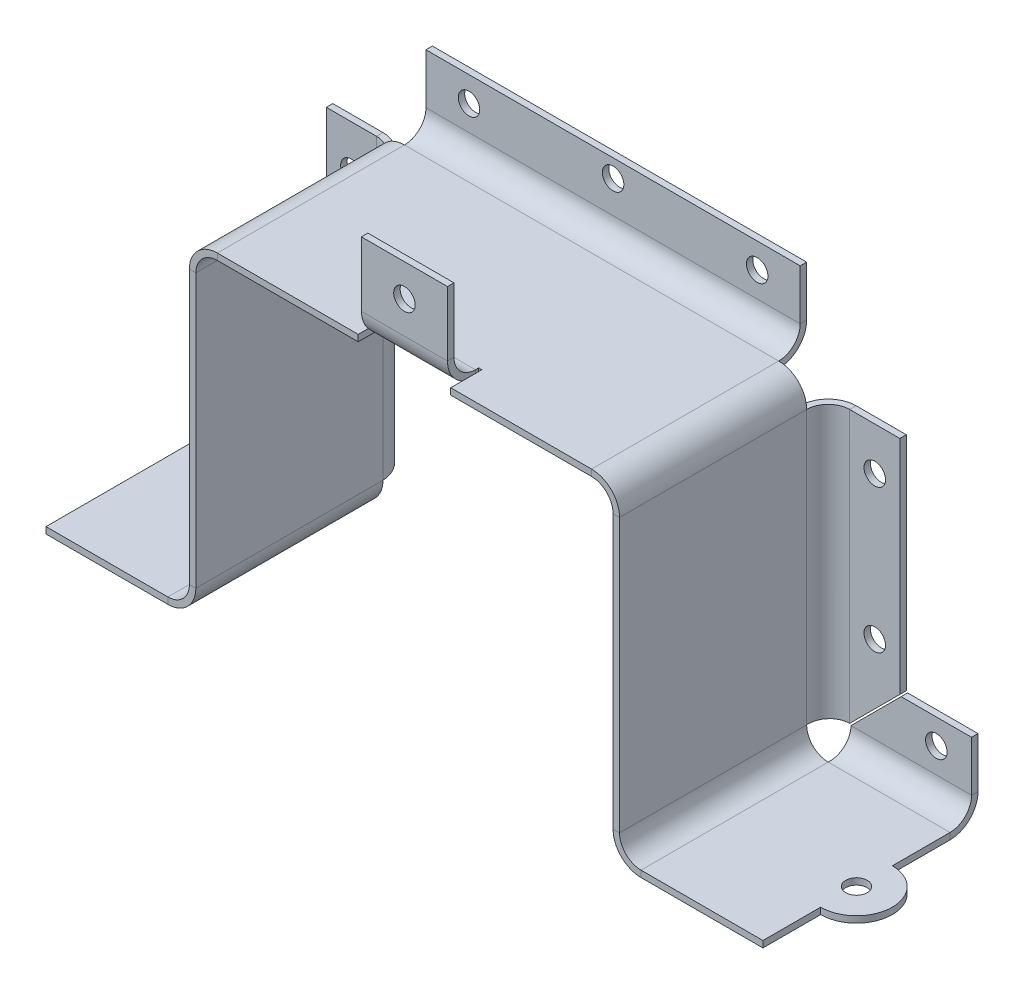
ISO-10303-21;
HEADER;
FILE_DESCRIPTION(('STEP AP214'),'2;1');
FILE_NAME('part.step','',(''),(''),'','','');
FILE_SCHEMA(('AUTOMOTIVE_DESIGN { 1 0 10303 214 1 1 1 1 }'));
ENDSEC;
DATA;
#1=APPLICATION_CONTEXT('core data for automotive mechanical design processes');
#2=APPLICATION_PROTOCOL_DEFINITION('international standard','automotive_design',2000,#1);
#3=PRODUCT_CONTEXT('',#1,'mechanical');
#4=PRODUCT('Part','Part','',(#3));
#5=PRODUCT_RELATED_PRODUCT_CATEGORY('part','',(#4));
#6=PRODUCT_DEFINITION_FORMATION('','',#4);
#7=PRODUCT_DEFINITION_CONTEXT('part definition',#1,'design');
#8=PRODUCT_DEFINITION('design','',#6,#7);
#9=PRODUCT_DEFINITION_SHAPE('','',#8);
#10=(LENGTH_UNIT() NAMED_UNIT(*) SI_UNIT(.MILLI.,.METRE.));
#11=(NAMED_UNIT(*) PLANE_ANGLE_UNIT() SI_UNIT($,.RADIAN.));
#12=(NAMED_UNIT(*) SI_UNIT($,.STERADIAN.) SOLID_ANGLE_UNIT());
#13=UNCERTAINTY_MEASURE_WITH_UNIT(LENGTH_MEASURE(1.E-05),#10,'distance_accuracy_value','');
#14=(GEOMETRIC_REPRESENTATION_CONTEXT(3) GLOBAL_UNCERTAINTY_ASSIGNED_CONTEXT((#13)) GLOBAL_UNIT_ASSIGNED_CONTEXT((#10,
#11,#12)) REPRESENTATION_CONTEXT('',''));
#15=CARTESIAN_POINT('',(0.,0.,0.));
#16=DIRECTION('',(0.,0.,1.));
#17=DIRECTION('',(1.,0.,0.));
#18=AXIS2_PLACEMENT_3D('',#15,#16,#17);
#19=CARTESIAN_POINT('',(50.,0.,30.));
#20=DIRECTION('',(1.,0.,0.));
#21=DIRECTION('',(0.,0.,-1.));
#22=AXIS2_PLACEMENT_3D('',#19,#20,#21);
#23=PLANE('',#22);
#24=DIRECTION('',(0.,1.,0.));
#25=VECTOR('',#24,1.);
#26=CARTESIAN_POINT('',(50.,-0.9,11.9500000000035));
#27=LINE('',#26,#25);
#28=CARTESIAN_POINT('',(50.,-0.9,11.9500000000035));
#29=VERTEX_POINT('',#28);
#30=CARTESIAN_POINT('',(50.,0.,11.9500000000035));
#31=VERTEX_POINT('',#30);
#32=EDGE_CURVE('E403',#29,#31,#27,.T.);
#33=ORIENTED_EDGE('',*,*,#32,.F.);
#34=DIRECTION('',(0.,0.,-1.));
#35=VECTOR('',#34,1.);
#36=CARTESIAN_POINT('',(50.,-0.9,30.));
#37=LINE('',#36,#35);
#38=CARTESIAN_POINT('',(50.,-0.9,3.9));
#39=VERTEX_POINT('',#38);
#40=EDGE_CURVE('E413',#29,#39,#37,.T.);
#41=ORIENTED_EDGE('',*,*,#40,.T.);
#42=DIRECTION('',(0.,-1.,0.));
#43=VECTOR('',#42,1.);
#44=CARTESIAN_POINT('',(50.0000000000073,-0.9,3.9));
#45=LINE('',#44,#43);
#46=CARTESIAN_POINT('',(50.0000000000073,0.,3.9));
#47=VERTEX_POINT('',#46);
#48=EDGE_CURVE('E852',#39,#47,#45,.F.);
#49=ORIENTED_EDGE('',*,*,#48,.T.);
#50=DIRECTION('',(0.,0.,-1.));
#51=VECTOR('',#50,1.);
#52=CARTESIAN_POINT('',(50.,0.,30.));
#53=LINE('',#52,#51);
#54=EDGE_CURVE('E585',#31,#47,#53,.T.);
#55=ORIENTED_EDGE('',*,*,#54,.F.);
#56=EDGE_LOOP('',(#33,#41,#49,#55));
#57=FACE_BOUND('',#56,.T.);
#58=ADVANCED_FACE('F56',(#57),#23,.T.);
#59=CARTESIAN_POINT('',(-33.,0.,3.9));
#60=DIRECTION('',(0.,0.,-1.));
#61=DIRECTION('',(-1.,0.,0.));
#62=AXIS2_PLACEMENT_3D('',#59,#60,#61);
#63=PLANE('',#62);
#64=CARTESIAN_POINT('',(-33.,3.,3.9));
#65=DIRECTION('',(0.,0.,1.));
#66=DIRECTION('',(1.,0.,0.));
#67=AXIS2_PLACEMENT_3D('',#64,#65,#66);
#68=CIRCLE('',#67,3.9);
#69=CARTESIAN_POINT('',(-33.,-0.9,3.9));
#70=VERTEX_POINT('',#69);
#71=CARTESIAN_POINT('',(-29.1,3.,3.9));
#72=VERTEX_POINT('',#71);
#73=EDGE_CURVE('E627',#70,#72,#68,.T.);
#74=ORIENTED_EDGE('',*,*,#73,.F.);
#75=DIRECTION('',(0.,-1.,0.));
#76=VECTOR('',#75,1.);
#77=CARTESIAN_POINT('',(-32.9999999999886,-0.900000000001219,3.9));
#78=LINE('',#77,#76);
#79=CARTESIAN_POINT('',(-32.9999999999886,-1.2190769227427E-12,3.9));
#80=VERTEX_POINT('',#79);
#81=EDGE_CURVE('E1005',#70,#80,#78,.F.);
#82=ORIENTED_EDGE('',*,*,#81,.T.);
#83=CARTESIAN_POINT('',(-33.,3.,3.9));
#84=DIRECTION('',(0.,0.,-1.));
#85=DIRECTION('',(-1.,0.,0.));
#86=AXIS2_PLACEMENT_3D('',#83,#84,#85);
#87=CIRCLE('',#86,3.);
#88=CARTESIAN_POINT('',(-30.,3.,3.9));
#89=VERTEX_POINT('',#88);
#90=EDGE_CURVE('E625',#80,#89,#87,.F.);
#91=ORIENTED_EDGE('',*,*,#90,.T.);
#92=DIRECTION('',(1.,0.,0.));
#93=VECTOR('',#92,1.);
#94=CARTESIAN_POINT('',(-29.0999999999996,3.,3.9));
#95=LINE('',#94,#93);
#96=EDGE_CURVE('E960',#72,#89,#95,.F.);
#97=ORIENTED_EDGE('',*,*,#96,.F.);
#98=EDGE_LOOP('',(#74,#82,#91,#97));
#99=FACE_BOUND('',#98,.T.);
#100=ADVANCED_FACE('F1154',(#99),#63,.T.);
#101=CARTESIAN_POINT('',(33.,3.00000000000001,3.9));
#102=DIRECTION('',(0.,0.,-1.));
#103=DIRECTION('',(-1.,0.,0.));
#104=AXIS2_PLACEMENT_3D('',#101,#102,#103);
#105=PLANE('',#104);
#106=CARTESIAN_POINT('',(33.,3.00000000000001,3.9));
#107=DIRECTION('',(0.,0.,-1.));
#108=DIRECTION('',(-1.,0.,0.));
#109=AXIS2_PLACEMENT_3D('',#106,#107,#108);
#110=CIRCLE('',#109,3.);
#111=CARTESIAN_POINT('',(30.,2.99999999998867,3.9));
#112=VERTEX_POINT('',#111);
#113=CARTESIAN_POINT('',(33.,0.,3.9));
#114=VERTEX_POINT('',#113);
#115=EDGE_CURVE('E611',#112,#114,#110,.F.);
#116=ORIENTED_EDGE('',*,*,#115,.T.);
#117=DIRECTION('',(0.,-1.,0.));
#118=VECTOR('',#117,1.);
#119=CARTESIAN_POINT('',(33.,-0.9,3.9));
#120=LINE('',#119,#118);
#121=CARTESIAN_POINT('',(33.,-0.9,3.9));
#122=VERTEX_POINT('',#121);
#123=EDGE_CURVE('E845',#122,#114,#120,.F.);
#124=ORIENTED_EDGE('',*,*,#123,.F.);
#125=CARTESIAN_POINT('',(33.,3.00000000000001,3.9));
#126=DIRECTION('',(0.,0.,1.));
#127=DIRECTION('',(1.,0.,0.));
#128=AXIS2_PLACEMENT_3D('',#125,#126,#127);
#129=CIRCLE('',#128,3.9);
#130=CARTESIAN_POINT('',(29.1,3.00000000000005,3.9));
#131=VERTEX_POINT('',#130);
#132=EDGE_CURVE('E604',#131,#122,#129,.T.);
#133=ORIENTED_EDGE('',*,*,#132,.F.);
#134=DIRECTION('',(-1.,0.,0.));
#135=VECTOR('',#134,1.);
#136=CARTESIAN_POINT('',(29.1,2.99999999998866,3.9));
#137=LINE('',#136,#135);
#138=EDGE_CURVE('E802',#131,#112,#137,.F.);
#139=ORIENTED_EDGE('',*,*,#138,.T.);
#140=EDGE_LOOP('',(#116,#124,#133,#139));
#141=FACE_BOUND('',#140,.T.);
#142=ADVANCED_FACE('F1160',(#141),#105,.T.);
#143=CARTESIAN_POINT('',(-30.,45.,30.));
#144=DIRECTION('',(0.,1.,0.));
#145=DIRECTION('',(0.,0.,1.));
#146=AXIS2_PLACEMENT_3D('',#143,#144,#145);
#147=PLANE('',#146);
#148=DIRECTION('',(0.,0.,-1.));
#149=VECTOR('',#148,1.);
#150=CARTESIAN_POINT('',(26.1,45.,30.));
#151=LINE('',#150,#149);
#152=CARTESIAN_POINT('',(26.1,45.,30.));
#153=VERTEX_POINT('',#152);
#154=CARTESIAN_POINT('',(26.1,45.,3.9));
#155=VERTEX_POINT('',#154);
#156=EDGE_CURVE('E575',#153,#155,#151,.T.);
#157=ORIENTED_EDGE('',*,*,#156,.T.);
#158=DIRECTION('',(-1.,0.,0.));
#159=VECTOR('',#158,1.);
#160=CARTESIAN_POINT('',(26.1000000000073,44.9999999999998,3.9));
#161=LINE('',#160,#159);
#162=CARTESIAN_POINT('',(-26.1,45.,3.9));
#163=VERTEX_POINT('',#162);
#164=EDGE_CURVE('E718',#155,#163,#161,.T.);
#165=ORIENTED_EDGE('',*,*,#164,.T.);
#166=DIRECTION('',(0.,0.,-1.));
#167=VECTOR('',#166,1.);
#168=CARTESIAN_POINT('',(-26.1,45.,30.));
#169=LINE('',#168,#167);
#170=CARTESIAN_POINT('',(-26.1,45.,30.));
#171=VERTEX_POINT('',#170);
#172=EDGE_CURVE('E572',#171,#163,#169,.T.);
#173=ORIENTED_EDGE('',*,*,#172,.F.);
#174=DIRECTION('',(1.,0.,0.));
#175=VECTOR('',#174,1.);
#176=CARTESIAN_POINT('',(-30.,45.,30.));
#177=LINE('',#176,#175);
#178=CARTESIAN_POINT('',(-6.45,45.,30.));
#179=VERTEX_POINT('',#178);
#180=EDGE_CURVE('E492',#171,#179,#177,.T.);
#181=ORIENTED_EDGE('',*,*,#180,.T.);
#182=DIRECTION('',(0.,0.,1.));
#183=VECTOR('',#182,1.);
#184=CARTESIAN_POINT('',(-6.45,45.,25.65));
#185=LINE('',#184,#183);
#186=CARTESIAN_POINT('',(-6.45,45.,25.65));
#187=VERTEX_POINT('',#186);
#188=EDGE_CURVE('E691',#187,#179,#185,.T.);
#189=ORIENTED_EDGE('',*,*,#188,.F.);
#190=DIRECTION('',(-1.,0.,0.));
#191=VECTOR('',#190,1.);
#192=CARTESIAN_POINT('',(-6.,45.,25.65));
#193=LINE('',#192,#191);
#194=CARTESIAN_POINT('',(-6.00000000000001,45.,25.65));
#195=VERTEX_POINT('',#194);
#196=EDGE_CURVE('E687',#195,#187,#193,.T.);
#197=ORIENTED_EDGE('',*,*,#196,.F.);
#198=DIRECTION('',(0.,0.,-1.));
#199=VECTOR('',#198,1.);
#200=CARTESIAN_POINT('',(-6.,45.,26.1));
#201=LINE('',#200,#199);
#202=CARTESIAN_POINT('',(-6.,45.,26.1));
#203=VERTEX_POINT('',#202);
#204=EDGE_CURVE('E684',#203,#195,#201,.T.);
#205=ORIENTED_EDGE('',*,*,#204,.F.);
#206=DIRECTION('',(1.,0.,0.));
#207=VECTOR('',#206,1.);
#208=CARTESIAN_POINT('',(6.,45.,26.1));
#209=LINE('',#208,#207);
#210=CARTESIAN_POINT('',(6.,45.,26.1));
#211=VERTEX_POINT('',#210);
#212=EDGE_CURVE('E673',#211,#203,#209,.F.);
#213=ORIENTED_EDGE('',*,*,#212,.F.);
#214=DIRECTION('',(0.,0.,1.));
#215=VECTOR('',#214,1.);
#216=CARTESIAN_POINT('',(6.,45.,25.65));
#217=LINE('',#216,#215);
#218=CARTESIAN_POINT('',(6.00000000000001,45.,25.65));
#219=VERTEX_POINT('',#218);
#220=EDGE_CURVE('E466',#219,#211,#217,.T.);
#221=ORIENTED_EDGE('',*,*,#220,.F.);
#222=DIRECTION('',(-1.,0.,0.));
#223=VECTOR('',#222,1.);
#224=CARTESIAN_POINT('',(6.45,45.,25.65));
#225=LINE('',#224,#223);
#226=CARTESIAN_POINT('',(6.45,45.,25.65));
#227=VERTEX_POINT('',#226);
#228=EDGE_CURVE('E79',#227,#219,#225,.T.);
#229=ORIENTED_EDGE('',*,*,#228,.F.);
#230=DIRECTION('',(0.,0.,-1.));
#231=VECTOR('',#230,1.);
#232=CARTESIAN_POINT('',(6.45,45.,30.));
#233=LINE('',#232,#231);
#234=CARTESIAN_POINT('',(6.45,45.,30.));
#235=VERTEX_POINT('',#234);
#236=EDGE_CURVE('E465',#235,#227,#233,.T.);
#237=ORIENTED_EDGE('',*,*,#236,.F.);
#238=EDGE_CURVE('E491',#235,#153,#177,.T.);
#239=ORIENTED_EDGE('',*,*,#238,.T.);
#240=EDGE_LOOP('',(#157,#165,#173,#181,#189,#197,#205,#213,#221,#229,#237,#239));
#241=FACE_BOUND('',#240,.T.);
#242=ADVANCED_FACE('F715',(#241),#147,.T.);
#243=CARTESIAN_POINT('',(-30.,44.1,30.));
#244=DIRECTION('',(0.,1.,0.));
#245=DIRECTION('',(0.,0.,1.));
#246=AXIS2_PLACEMENT_3D('',#243,#244,#245);
#247=PLANE('',#246);
#248=DIRECTION('',(-1.,0.,0.));
#249=VECTOR('',#248,1.);
#250=CARTESIAN_POINT('',(26.1000000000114,44.0999999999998,3.9));
#251=LINE('',#250,#249);
#252=CARTESIAN_POINT('',(26.1000000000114,44.0999999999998,3.9));
#253=VERTEX_POINT('',#252);
#254=CARTESIAN_POINT('',(-26.1,44.1,3.9));
#255=VERTEX_POINT('',#254);
#256=EDGE_CURVE('E899',#253,#255,#251,.T.);
#257=ORIENTED_EDGE('',*,*,#256,.F.);
#258=DIRECTION('',(0.,0.,-1.));
#259=VECTOR('',#258,1.);
#260=CARTESIAN_POINT('',(26.1,44.1,30.));
#261=LINE('',#260,#259);
#262=CARTESIAN_POINT('',(26.1,44.1,30.));
#263=VERTEX_POINT('',#262);
#264=EDGE_CURVE('E544',#263,#253,#261,.T.);
#265=ORIENTED_EDGE('',*,*,#264,.F.);
#266=DIRECTION('',(1.,0.,0.));
#267=VECTOR('',#266,1.);
#268=CARTESIAN_POINT('',(-30.,44.1,30.));
#269=LINE('',#268,#267);
#270=CARTESIAN_POINT('',(6.45,44.1,30.));
#271=VERTEX_POINT('',#270);
#272=EDGE_CURVE('E522',#271,#263,#269,.T.);
#273=ORIENTED_EDGE('',*,*,#272,.F.);
#274=DIRECTION('',(0.,0.,1.));
#275=VECTOR('',#274,1.);
#276=CARTESIAN_POINT('',(6.45,44.1,30.));
#277=LINE('',#276,#275);
#278=CARTESIAN_POINT('',(6.45,44.1,25.65));
#279=VERTEX_POINT('',#278);
#280=EDGE_CURVE('E13',#279,#271,#277,.T.);
#281=ORIENTED_EDGE('',*,*,#280,.F.);
#282=DIRECTION('',(1.,0.,0.));
#283=VECTOR('',#282,1.);
#284=CARTESIAN_POINT('',(-30.,44.1,25.65));
#285=LINE('',#284,#283);
#286=CARTESIAN_POINT('',(6.00000000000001,44.1,25.65));
#287=VERTEX_POINT('',#286);
#288=EDGE_CURVE('E64',#287,#279,#285,.T.);
#289=ORIENTED_EDGE('',*,*,#288,.F.);
#290=DIRECTION('',(0.,0.,-1.));
#291=VECTOR('',#290,1.);
#292=CARTESIAN_POINT('',(6.00000000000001,44.1,30.));
#293=LINE('',#292,#291);
#294=CARTESIAN_POINT('',(6.,44.1,26.1));
#295=VERTEX_POINT('',#294);
#296=EDGE_CURVE('E449',#295,#287,#293,.T.);
#297=ORIENTED_EDGE('',*,*,#296,.F.);
#298=DIRECTION('',(1.,0.,0.));
#299=VECTOR('',#298,1.);
#300=CARTESIAN_POINT('',(6.,44.1,26.1));
#301=LINE('',#300,#299);
#302=CARTESIAN_POINT('',(-6.,44.1,26.1));
#303=VERTEX_POINT('',#302);
#304=EDGE_CURVE('E661',#295,#303,#301,.F.);
#305=ORIENTED_EDGE('',*,*,#304,.T.);
#306=DIRECTION('',(0.,0.,1.));
#307=VECTOR('',#306,1.);
#308=CARTESIAN_POINT('',(-6.,44.1,30.));
#309=LINE('',#308,#307);
#310=CARTESIAN_POINT('',(-6.00000000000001,44.1,25.65));
#311=VERTEX_POINT('',#310);
#312=EDGE_CURVE('E446',#311,#303,#309,.T.);
#313=ORIENTED_EDGE('',*,*,#312,.F.);
#314=DIRECTION('',(1.,0.,0.));
#315=VECTOR('',#314,1.);
#316=CARTESIAN_POINT('',(-30.,44.1,25.65));
#317=LINE('',#316,#315);
#318=CARTESIAN_POINT('',(-6.45,44.1,25.65));
#319=VERTEX_POINT('',#318);
#320=EDGE_CURVE('E443',#319,#311,#317,.T.);
#321=ORIENTED_EDGE('',*,*,#320,.F.);
#322=DIRECTION('',(0.,0.,-1.));
#323=VECTOR('',#322,1.);
#324=CARTESIAN_POINT('',(-6.45,44.1,30.));
#325=LINE('',#324,#323);
#326=CARTESIAN_POINT('',(-6.45,44.1,30.));
#327=VERTEX_POINT('',#326);
#328=EDGE_CURVE('E440',#327,#319,#325,.T.);
#329=ORIENTED_EDGE('',*,*,#328,.F.);
#330=CARTESIAN_POINT('',(-26.1,44.1,30.));
#331=VERTEX_POINT('',#330);
#332=EDGE_CURVE('E523',#331,#327,#269,.T.);
#333=ORIENTED_EDGE('',*,*,#332,.F.);
#334=DIRECTION('',(0.,0.,-1.));
#335=VECTOR('',#334,1.);
#336=CARTESIAN_POINT('',(-26.1,44.1,30.));
#337=LINE('',#336,#335);
#338=EDGE_CURVE('E546',#331,#255,#337,.T.);
#339=ORIENTED_EDGE('',*,*,#338,.T.);
#340=EDGE_LOOP('',(#257,#265,#273,#281,#289,#297,#305,#313,#321,#329,#333,#339));
#341=FACE_BOUND('',#340,.T.);
#342=ADVANCED_FACE('F707',(#341),#247,.F.);
#343=CARTESIAN_POINT('',(30.,-0.9,30.));
#344=DIRECTION('',(0.,1.,0.));
#345=DIRECTION('',(0.,0.,1.));
#346=AXIS2_PLACEMENT_3D('',#343,#344,#345);
#347=PLANE('',#346);
#348=CARTESIAN_POINT('',(50.0000000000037,-0.900000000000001,16.95));
#349=DIRECTION('',(0.,1.,0.));
#350=DIRECTION('',(0.,0.,1.));
#351=AXIS2_PLACEMENT_3D('',#348,#349,#350);
#352=CIRCLE('',#351,1.49999999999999);
#353=CARTESIAN_POINT('',(50.0000000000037,-0.900000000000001,18.45));
#354=VERTEX_POINT('',#353);
#355=EDGE_CURVE('E1057',#354,#354,#352,.T.);
#356=ORIENTED_EDGE('',*,*,#355,.T.);
#357=EDGE_LOOP('',(#356));
#358=FACE_BOUND('',#357,.T.);
#359=ORIENTED_EDGE('',*,*,#40,.F.);
#360=CARTESIAN_POINT('',(50.0000000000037,-0.9,16.95));
#361=DIRECTION('',(0.,1.,0.));
#362=DIRECTION('',(0.,0.,1.));
#363=AXIS2_PLACEMENT_3D('',#360,#361,#362);
#364=CIRCLE('',#363,4.9999999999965);
#365=CARTESIAN_POINT('',(50.,-0.9,21.9499999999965));
#366=VERTEX_POINT('',#365);
#367=EDGE_CURVE('E399',#366,#29,#364,.T.);
#368=ORIENTED_EDGE('',*,*,#367,.F.);
#369=CARTESIAN_POINT('',(50.,-0.9,30.));
#370=VERTEX_POINT('',#369);
#371=EDGE_CURVE('E410',#370,#366,#37,.T.);
#372=ORIENTED_EDGE('',*,*,#371,.F.);
#373=DIRECTION('',(1.,0.,0.));
#374=VECTOR('',#373,1.);
#375=CARTESIAN_POINT('',(30.,-0.9,30.));
#376=LINE('',#375,#374);
#377=CARTESIAN_POINT('',(33.,-0.9,30.));
#378=VERTEX_POINT('',#377);
#379=EDGE_CURVE('E476',#378,#370,#376,.T.);
#380=ORIENTED_EDGE('',*,*,#379,.F.);
#381=DIRECTION('',(0.,0.,-1.));
#382=VECTOR('',#381,1.);
#383=CARTESIAN_POINT('',(33.,-0.9,30.));
#384=LINE('',#383,#382);
#385=EDGE_CURVE('E535',#378,#122,#384,.T.);
#386=ORIENTED_EDGE('',*,*,#385,.T.);
#387=DIRECTION('',(-1.,0.,0.));
#388=VECTOR('',#387,1.);
#389=CARTESIAN_POINT('',(311.000000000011,-0.9,3.9));
#390=LINE('',#389,#388);
#391=EDGE_CURVE('E598',#39,#122,#390,.T.);
#392=ORIENTED_EDGE('',*,*,#391,.F.);
#393=EDGE_LOOP('',(#359,#368,#372,#380,#386,#392));
#394=FACE_BOUND('',#393,.T.);
#395=ADVANCED_FACE('F408',(#358,#394),#347,.F.);
#396=DIRECTION('',(0.,1.,0.));
#397=VECTOR('',#396,1.);
#398=CARTESIAN_POINT('',(50.,-0.9,21.9499999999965));
#399=LINE('',#398,#397);
#400=CARTESIAN_POINT('',(50.,0.,21.9499999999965));
#401=VERTEX_POINT('',#400);
#402=EDGE_CURVE('E396',#401,#366,#399,.F.);
#403=ORIENTED_EDGE('',*,*,#402,.F.);
#404=CARTESIAN_POINT('',(50.,0.,30.));
#405=VERTEX_POINT('',#404);
#406=EDGE_CURVE('E422',#405,#401,#53,.T.);
#407=ORIENTED_EDGE('',*,*,#406,.F.);
#408=DIRECTION('',(0.,-1.,0.));
#409=VECTOR('',#408,1.);
#410=CARTESIAN_POINT('',(50.,0.,30.));
#411=LINE('',#410,#409);
#412=EDGE_CURVE('E417',#405,#370,#411,.T.);
#413=ORIENTED_EDGE('',*,*,#412,.T.);
#414=ORIENTED_EDGE('',*,*,#371,.T.);
#415=EDGE_LOOP('',(#403,#407,#413,#414));
#416=FACE_BOUND('',#415,.T.);
#417=ADVANCED_FACE('F415',(#416),#23,.T.);
#418=CARTESIAN_POINT('',(30.,0.,30.));
#419=DIRECTION('',(0.,1.,0.));
#420=DIRECTION('',(0.,0.,1.));
#421=AXIS2_PLACEMENT_3D('',#418,#419,#420);
#422=PLANE('',#421);
#423=CARTESIAN_POINT('',(50.0000000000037,0.,16.95));
#424=DIRECTION('',(0.,1.,0.));
#425=DIRECTION('',(0.,0.,1.));
#426=AXIS2_PLACEMENT_3D('',#423,#424,#425);
#427=CIRCLE('',#426,1.5);
#428=CARTESIAN_POINT('',(50.0000000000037,0.,18.45));
#429=VERTEX_POINT('',#428);
#430=EDGE_CURVE('E1060',#429,#429,#427,.T.);
#431=ORIENTED_EDGE('',*,*,#430,.F.);
#432=EDGE_LOOP('',(#431));
#433=FACE_BOUND('',#432,.T.);
#434=ORIENTED_EDGE('',*,*,#406,.T.);
#435=CARTESIAN_POINT('',(50.0000000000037,0.,16.95));
#436=DIRECTION('',(0.,1.,0.));
#437=DIRECTION('',(0.,0.,1.));
#438=AXIS2_PLACEMENT_3D('',#435,#436,#437);
#439=CIRCLE('',#438,4.9999999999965);
#440=EDGE_CURVE('E71',#401,#31,#439,.T.);
#441=ORIENTED_EDGE('',*,*,#440,.T.);
#442=ORIENTED_EDGE('',*,*,#54,.T.);
#443=DIRECTION('',(-1.,0.,0.));
#444=VECTOR('',#443,1.);
#445=CARTESIAN_POINT('',(311.000000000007,0.,3.9));
#446=LINE('',#445,#444);
#447=EDGE_CURVE('E837',#47,#114,#446,.T.);
#448=ORIENTED_EDGE('',*,*,#447,.T.);
#449=DIRECTION('',(0.,0.,-1.));
#450=VECTOR('',#449,1.);
#451=CARTESIAN_POINT('',(33.,0.,30.));
#452=LINE('',#451,#450);
#453=CARTESIAN_POINT('',(33.,0.,30.));
#454=VERTEX_POINT('',#453);
#455=EDGE_CURVE('E583',#454,#114,#452,.T.);
#456=ORIENTED_EDGE('',*,*,#455,.F.);
#457=DIRECTION('',(1.,0.,0.));
#458=VECTOR('',#457,1.);
#459=CARTESIAN_POINT('',(30.,0.,30.));
#460=LINE('',#459,#458);
#461=EDGE_CURVE('E479',#454,#405,#460,.T.);
#462=ORIENTED_EDGE('',*,*,#461,.T.);
#463=EDGE_LOOP('',(#434,#441,#442,#448,#456,#462));
#464=FACE_BOUND('',#463,.T.);
#465=ADVANCED_FACE('F592',(#433,#464),#422,.T.);
#466=CARTESIAN_POINT('',(33.,3.00000000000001,30.));
#467=DIRECTION('',(0.,0.,-1.));
#468=DIRECTION('',(-1.,0.,0.));
#469=AXIS2_PLACEMENT_3D('',#466,#467,#468);
#470=CYLINDRICAL_SURFACE('',#469,3.);
#471=ORIENTED_EDGE('',*,*,#455,.T.);
#472=ORIENTED_EDGE('',*,*,#115,.F.);
#473=DIRECTION('',(0.,0.,-1.));
#474=VECTOR('',#473,1.);
#475=CARTESIAN_POINT('',(30.,3.00000000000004,30.));
#476=LINE('',#475,#474);
#477=CARTESIAN_POINT('',(30.,3.00000000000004,30.));
#478=VERTEX_POINT('',#477);
#479=EDGE_CURVE('E581',#478,#112,#476,.T.);
#480=ORIENTED_EDGE('',*,*,#479,.F.);
#481=CARTESIAN_POINT('',(33.,3.00000000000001,30.));
#482=DIRECTION('',(0.,0.,-1.));
#483=DIRECTION('',(-1.,0.,0.));
#484=AXIS2_PLACEMENT_3D('',#481,#482,#483);
#485=CIRCLE('',#484,3.);
#486=EDGE_CURVE('E482',#478,#454,#485,.F.);
#487=ORIENTED_EDGE('',*,*,#486,.T.);
#488=EDGE_LOOP('',(#471,#472,#480,#487));
#489=FACE_BOUND('',#488,.T.);
#490=ADVANCED_FACE('F1170',(#489),#470,.F.);
#491=CARTESIAN_POINT('',(30.,45.,30.));
#492=DIRECTION('',(1.,0.,0.));
#493=DIRECTION('',(0.,0.,-1.));
#494=AXIS2_PLACEMENT_3D('',#491,#492,#493);
#495=PLANE('',#494);
#496=ORIENTED_EDGE('',*,*,#479,.T.);
#497=DIRECTION('',(0.,1.,0.));
#498=VECTOR('',#497,1.);
#499=CARTESIAN_POINT('',(30.,2.99999999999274,3.9));
#500=LINE('',#499,#498);
#501=CARTESIAN_POINT('',(29.9999999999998,41.1,3.9));
#502=VERTEX_POINT('',#501);
#503=EDGE_CURVE('E787',#112,#502,#500,.T.);
#504=ORIENTED_EDGE('',*,*,#503,.T.);
#505=DIRECTION('',(0.,0.,-1.));
#506=VECTOR('',#505,1.);
#507=CARTESIAN_POINT('',(30.,41.1,30.));
#508=LINE('',#507,#506);
#509=CARTESIAN_POINT('',(30.,41.1,30.));
#510=VERTEX_POINT('',#509);
#511=EDGE_CURVE('E578',#510,#502,#508,.T.);
#512=ORIENTED_EDGE('',*,*,#511,.F.);
#513=DIRECTION('',(0.,-1.,0.));
#514=VECTOR('',#513,1.);
#515=CARTESIAN_POINT('',(30.,45.,30.));
#516=LINE('',#515,#514);
#517=EDGE_CURVE('E485',#510,#478,#516,.T.);
#518=ORIENTED_EDGE('',*,*,#517,.T.);
#519=EDGE_LOOP('',(#496,#504,#512,#518));
#520=FACE_BOUND('',#519,.T.);
#521=ADVANCED_FACE('F1367',(#520),#495,.T.);
#522=CARTESIAN_POINT('',(26.1,41.1,30.));
#523=DIRECTION('',(0.,0.,-1.));
#524=DIRECTION('',(-1.,0.,0.));
#525=AXIS2_PLACEMENT_3D('',#522,#523,#524);
#526=CYLINDRICAL_SURFACE('',#525,3.9);
#527=ORIENTED_EDGE('',*,*,#511,.T.);
#528=CARTESIAN_POINT('',(26.1,41.1,3.9));
#529=DIRECTION('',(0.,0.,1.));
#530=DIRECTION('',(1.,0.,0.));
#531=AXIS2_PLACEMENT_3D('',#528,#529,#530);
#532=CIRCLE('',#531,3.9);
#533=EDGE_CURVE('E610',#155,#502,#532,.F.);
#534=ORIENTED_EDGE('',*,*,#533,.F.);
#535=ORIENTED_EDGE('',*,*,#156,.F.);
#536=CARTESIAN_POINT('',(26.1,41.1,30.));
#537=DIRECTION('',(0.,0.,1.));
#538=DIRECTION('',(1.,0.,0.));
#539=AXIS2_PLACEMENT_3D('',#536,#537,#538);
#540=CIRCLE('',#539,3.9);
#541=EDGE_CURVE('E488',#153,#510,#540,.F.);
#542=ORIENTED_EDGE('',*,*,#541,.T.);
#543=EDGE_LOOP('',(#527,#534,#535,#542));
#544=FACE_BOUND('',#543,.T.);
#545=ADVANCED_FACE('F1377',(#544),#526,.T.);
#546=CARTESIAN_POINT('',(-26.1,41.1,30.));
#547=DIRECTION('',(0.,0.,-1.));
#548=DIRECTION('',(-1.,0.,0.));
#549=AXIS2_PLACEMENT_3D('',#546,#547,#548);
#550=CYLINDRICAL_SURFACE('',#549,3.9);
#551=ORIENTED_EDGE('',*,*,#172,.T.);
#552=CARTESIAN_POINT('',(-26.1,41.1,3.9));
#553=DIRECTION('',(0.,0.,1.));
#554=DIRECTION('',(1.,0.,0.));
#555=AXIS2_PLACEMENT_3D('',#552,#553,#554);
#556=CIRCLE('',#555,3.9);
#557=CARTESIAN_POINT('',(-30.,41.1,3.9));
#558=VERTEX_POINT('',#557);
#559=EDGE_CURVE('E622',#558,#163,#556,.F.);
#560=ORIENTED_EDGE('',*,*,#559,.F.);
#561=DIRECTION('',(0.,0.,-1.));
#562=VECTOR('',#561,1.);
#563=CARTESIAN_POINT('',(-30.,41.1,30.));
#564=LINE('',#563,#562);
#565=CARTESIAN_POINT('',(-30.,41.1,30.));
#566=VERTEX_POINT('',#565);
#567=EDGE_CURVE('E569',#566,#558,#564,.T.);
#568=ORIENTED_EDGE('',*,*,#567,.F.);
#569=CARTESIAN_POINT('',(-26.1,41.1,30.));
#570=DIRECTION('',(0.,0.,1.));
#571=DIRECTION('',(1.,0.,0.));
#572=AXIS2_PLACEMENT_3D('',#569,#570,#571);
#573=CIRCLE('',#572,3.9);
#574=EDGE_CURVE('E495',#566,#171,#573,.F.);
#575=ORIENTED_EDGE('',*,*,#574,.T.);
#576=EDGE_LOOP('',(#551,#560,#568,#575));
#577=FACE_BOUND('',#576,.T.);
#578=ADVANCED_FACE('F722',(#577),#550,.T.);
#579=CARTESIAN_POINT('',(-30.,0.,30.));
#580=DIRECTION('',(-1.,0.,0.));
#581=DIRECTION('',(0.,0.,1.));
#582=AXIS2_PLACEMENT_3D('',#579,#580,#581);
#583=PLANE('',#582);
#584=ORIENTED_EDGE('',*,*,#567,.T.);
#585=DIRECTION('',(0.,-1.,0.));
#586=VECTOR('',#585,1.);
#587=CARTESIAN_POINT('',(-30.,41.1000000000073,3.9));
#588=LINE('',#587,#586);
#589=EDGE_CURVE('E976',#558,#89,#588,.T.);
#590=ORIENTED_EDGE('',*,*,#589,.T.);
#591=DIRECTION('',(0.,0.,-1.));
#592=VECTOR('',#591,1.);
#593=CARTESIAN_POINT('',(-30.,3.,30.));
#594=LINE('',#593,#592);
#595=CARTESIAN_POINT('',(-30.,3.,30.));
#596=VERTEX_POINT('',#595);
#597=EDGE_CURVE('E566',#596,#89,#594,.T.);
#598=ORIENTED_EDGE('',*,*,#597,.F.);
#599=DIRECTION('',(0.,1.,0.));
#600=VECTOR('',#599,1.);
#601=CARTESIAN_POINT('',(-30.,0.,30.));
#602=LINE('',#601,#600);
#603=EDGE_CURVE('E498',#596,#566,#602,.T.);
#604=ORIENTED_EDGE('',*,*,#603,.T.);
#605=EDGE_LOOP('',(#584,#590,#598,#604));
#606=FACE_BOUND('',#605,.T.);
#607=ADVANCED_FACE('F1396',(#606),#583,.T.);
#608=CARTESIAN_POINT('',(-33.,3.,30.));
#609=DIRECTION('',(0.,0.,-1.));
#610=DIRECTION('',(-1.,0.,0.));
#611=AXIS2_PLACEMENT_3D('',#608,#609,#610);
#612=CYLINDRICAL_SURFACE('',#611,3.);
#613=ORIENTED_EDGE('',*,*,#597,.T.);
#614=ORIENTED_EDGE('',*,*,#90,.F.);
#615=DIRECTION('',(0.,0.,-1.));
#616=VECTOR('',#615,1.);
#617=CARTESIAN_POINT('',(-33.,0.,30.));
#618=LINE('',#617,#616);
#619=CARTESIAN_POINT('',(-33.,0.,30.));
#620=VERTEX_POINT('',#619);
#621=EDGE_CURVE('E563',#620,#80,#618,.T.);
#622=ORIENTED_EDGE('',*,*,#621,.F.);
#623=CARTESIAN_POINT('',(-33.,3.,30.));
#624=DIRECTION('',(0.,0.,-1.));
#625=DIRECTION('',(-1.,0.,0.));
#626=AXIS2_PLACEMENT_3D('',#623,#624,#625);
#627=CIRCLE('',#626,3.);
#628=EDGE_CURVE('E501',#620,#596,#627,.F.);
#629=ORIENTED_EDGE('',*,*,#628,.T.);
#630=EDGE_LOOP('',(#613,#614,#622,#629));
#631=FACE_BOUND('',#630,.T.);
#632=ADVANCED_FACE('F1213',(#631),#612,.F.);
#633=CARTESIAN_POINT('',(-50.,0.,30.));
#634=DIRECTION('',(0.,1.,0.));
#635=DIRECTION('',(0.,0.,1.));
#636=AXIS2_PLACEMENT_3D('',#633,#634,#635);
#637=PLANE('',#636);
#638=ORIENTED_EDGE('',*,*,#621,.T.);
#639=DIRECTION('',(-1.,0.,0.));
#640=VECTOR('',#639,1.);
#641=CARTESIAN_POINT('',(-32.9999999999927,-1.2190769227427E-12,3.9));
#642=LINE('',#641,#640);
#643=CARTESIAN_POINT('',(-50.0000000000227,-1.2190769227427E-12,3.9));
#644=VERTEX_POINT('',#643);
#645=EDGE_CURVE('E1024',#80,#644,#642,.T.);
#646=ORIENTED_EDGE('',*,*,#645,.T.);
#647=DIRECTION('',(0.,0.,-1.));
#648=VECTOR('',#647,1.);
#649=CARTESIAN_POINT('',(-50.,0.,30.));
#650=LINE('',#649,#648);
#651=CARTESIAN_POINT('',(-50.,0.,30.));
#652=VERTEX_POINT('',#651);
#653=EDGE_CURVE('E560',#652,#644,#650,.T.);
#654=ORIENTED_EDGE('',*,*,#653,.F.);
#655=DIRECTION('',(1.,0.,0.));
#656=VECTOR('',#655,1.);
#657=CARTESIAN_POINT('',(-50.,0.,30.));
#658=LINE('',#657,#656);
#659=EDGE_CURVE('E504',#652,#620,#658,.T.);
#660=ORIENTED_EDGE('',*,*,#659,.T.);
#661=EDGE_LOOP('',(#638,#646,#654,#660));
#662=FACE_BOUND('',#661,.T.);
#663=ADVANCED_FACE('F1218',(#662),#637,.T.);
#664=CARTESIAN_POINT('',(-50.,-0.9,30.));
#665=DIRECTION('',(-1.,0.,0.));
#666=DIRECTION('',(0.,0.,1.));
#667=AXIS2_PLACEMENT_3D('',#664,#665,#666);
#668=PLANE('',#667);
#669=ORIENTED_EDGE('',*,*,#653,.T.);
#670=DIRECTION('',(0.,-1.,0.));
#671=VECTOR('',#670,1.);
#672=CARTESIAN_POINT('',(-50.0000000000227,-0.900000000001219,3.9));
#673=LINE('',#672,#671);
#674=CARTESIAN_POINT('',(-50.0000000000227,-0.900000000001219,3.9));
#675=VERTEX_POINT('',#674);
#676=EDGE_CURVE('E1015',#675,#644,#673,.F.);
#677=ORIENTED_EDGE('',*,*,#676,.F.);
#678=DIRECTION('',(0.,0.,-1.));
#679=VECTOR('',#678,1.);
#680=CARTESIAN_POINT('',(-50.,-0.9,30.));
#681=LINE('',#680,#679);
#682=CARTESIAN_POINT('',(-50.,-0.9,30.));
#683=VERTEX_POINT('',#682);
#684=EDGE_CURVE('E557',#683,#675,#681,.T.);
#685=ORIENTED_EDGE('',*,*,#684,.F.);
#686=DIRECTION('',(0.,1.,0.));
#687=VECTOR('',#686,1.);
#688=CARTESIAN_POINT('',(-50.,-0.9,30.));
#689=LINE('',#688,#687);
#690=EDGE_CURVE('E507',#683,#652,#689,.T.);
#691=ORIENTED_EDGE('',*,*,#690,.T.);
#692=EDGE_LOOP('',(#669,#677,#685,#691));
#693=FACE_BOUND('',#692,.T.);
#694=ADVANCED_FACE('F1222',(#693),#668,.T.);
#695=CARTESIAN_POINT('',(-50.,-0.9,30.));
#696=DIRECTION('',(0.,1.,0.));
#697=DIRECTION('',(0.,0.,1.));
#698=AXIS2_PLACEMENT_3D('',#695,#696,#697);
#699=PLANE('',#698);
#700=DIRECTION('',(-1.,0.,0.));
#701=VECTOR('',#700,1.);
#702=CARTESIAN_POINT('',(-32.9999999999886,-0.900000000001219,3.9));
#703=LINE('',#702,#701);
#704=EDGE_CURVE('E1028',#70,#675,#703,.T.);
#705=ORIENTED_EDGE('',*,*,#704,.F.);
#706=DIRECTION('',(0.,0.,-1.));
#707=VECTOR('',#706,1.);
#708=CARTESIAN_POINT('',(-33.,-0.9,30.));
#709=LINE('',#708,#707);
#710=CARTESIAN_POINT('',(-33.,-0.9,30.));
#711=VERTEX_POINT('',#710);
#712=EDGE_CURVE('E554',#711,#70,#709,.T.);
#713=ORIENTED_EDGE('',*,*,#712,.F.);
#714=DIRECTION('',(1.,0.,0.));
#715=VECTOR('',#714,1.);
#716=CARTESIAN_POINT('',(-50.,-0.9,30.));
#717=LINE('',#716,#715);
#718=EDGE_CURVE('E510',#683,#711,#717,.T.);
#719=ORIENTED_EDGE('',*,*,#718,.F.);
#720=ORIENTED_EDGE('',*,*,#684,.T.);
#721=EDGE_LOOP('',(#705,#713,#719,#720));
#722=FACE_BOUND('',#721,.T.);
#723=ADVANCED_FACE('F1228',(#722),#699,.F.);
#724=CARTESIAN_POINT('',(-33.,3.,30.));
#725=DIRECTION('',(0.,0.,-1.));
#726=DIRECTION('',(-1.,0.,0.));
#727=AXIS2_PLACEMENT_3D('',#724,#725,#726);
#728=CYLINDRICAL_SURFACE('',#727,3.9);
#729=ORIENTED_EDGE('',*,*,#73,.T.);
#730=DIRECTION('',(0.,0.,-1.));
#731=VECTOR('',#730,1.);
#732=CARTESIAN_POINT('',(-29.1,3.,30.));
#733=LINE('',#732,#731);
#734=CARTESIAN_POINT('',(-29.1,3.,30.));
#735=VERTEX_POINT('',#734);
#736=EDGE_CURVE('E551',#735,#72,#733,.T.);
#737=ORIENTED_EDGE('',*,*,#736,.F.);
#738=CARTESIAN_POINT('',(-33.,3.,30.));
#739=DIRECTION('',(0.,0.,1.));
#740=DIRECTION('',(1.,0.,0.));
#741=AXIS2_PLACEMENT_3D('',#738,#739,#740);
#742=CIRCLE('',#741,3.9);
#743=EDGE_CURVE('E513',#711,#735,#742,.T.);
#744=ORIENTED_EDGE('',*,*,#743,.F.);
#745=ORIENTED_EDGE('',*,*,#712,.T.);
#746=EDGE_LOOP('',(#729,#737,#744,#745));
#747=FACE_BOUND('',#746,.T.);
#748=ADVANCED_FACE('F1232',(#747),#728,.T.);
#749=CARTESIAN_POINT('',(-29.1,0.,30.));
#750=DIRECTION('',(-1.,0.,0.));
#751=DIRECTION('',(0.,0.,1.));
#752=AXIS2_PLACEMENT_3D('',#749,#750,#751);
#753=PLANE('',#752);
#754=DIRECTION('',(0.,-1.,0.));
#755=VECTOR('',#754,1.);
#756=CARTESIAN_POINT('',(-29.1,41.1000000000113,3.9));
#757=LINE('',#756,#755);
#758=CARTESIAN_POINT('',(-29.1,41.1000000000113,3.9));
#759=VERTEX_POINT('',#758);
#760=EDGE_CURVE('E969',#759,#72,#757,.T.);
#761=ORIENTED_EDGE('',*,*,#760,.F.);
#762=DIRECTION('',(0.,0.,-1.));
#763=VECTOR('',#762,1.);
#764=CARTESIAN_POINT('',(-29.1,41.1,30.));
#765=LINE('',#764,#763);
#766=CARTESIAN_POINT('',(-29.1,41.1,30.));
#767=VERTEX_POINT('',#766);
#768=EDGE_CURVE('E549',#767,#759,#765,.T.);
#769=ORIENTED_EDGE('',*,*,#768,.F.);
#770=DIRECTION('',(0.,1.,0.));
#771=VECTOR('',#770,1.);
#772=CARTESIAN_POINT('',(-29.1,0.,30.));
#773=LINE('',#772,#771);
#774=EDGE_CURVE('E516',#735,#767,#773,.T.);
#775=ORIENTED_EDGE('',*,*,#774,.F.);
#776=ORIENTED_EDGE('',*,*,#736,.T.);
#777=EDGE_LOOP('',(#761,#769,#775,#776));
#778=FACE_BOUND('',#777,.T.);
#779=ADVANCED_FACE('F1237',(#778),#753,.F.);
#780=CARTESIAN_POINT('',(-26.1,41.1,30.));
#781=DIRECTION('',(0.,0.,-1.));
#782=DIRECTION('',(-1.,0.,0.));
#783=AXIS2_PLACEMENT_3D('',#780,#781,#782);
#784=CYLINDRICAL_SURFACE('',#783,3.);
#785=CARTESIAN_POINT('',(-26.1,41.1,3.9));
#786=DIRECTION('',(0.,0.,1.));
#787=DIRECTION('',(1.,0.,0.));
#788=AXIS2_PLACEMENT_3D('',#785,#786,#787);
#789=CIRCLE('',#788,3.);
#790=EDGE_CURVE('E624',#759,#255,#789,.F.);
#791=ORIENTED_EDGE('',*,*,#790,.T.);
#792=ORIENTED_EDGE('',*,*,#338,.F.);
#793=CARTESIAN_POINT('',(-26.1,41.1,30.));
#794=DIRECTION('',(0.,0.,1.));
#795=DIRECTION('',(1.,0.,0.));
#796=AXIS2_PLACEMENT_3D('',#793,#794,#795);
#797=CIRCLE('',#796,3.);
#798=EDGE_CURVE('E519',#767,#331,#797,.F.);
#799=ORIENTED_EDGE('',*,*,#798,.F.);
#800=ORIENTED_EDGE('',*,*,#768,.T.);
#801=EDGE_LOOP('',(#791,#792,#799,#800));
#802=FACE_BOUND('',#801,.T.);
#803=ADVANCED_FACE('F893',(#802),#784,.F.);
#804=CARTESIAN_POINT('',(26.1,41.1,30.));
#805=DIRECTION('',(0.,0.,-1.));
#806=DIRECTION('',(-1.,0.,0.));
#807=AXIS2_PLACEMENT_3D('',#804,#805,#806);
#808=CYLINDRICAL_SURFACE('',#807,3.);
#809=CARTESIAN_POINT('',(26.1,41.1,3.9));
#810=DIRECTION('',(0.,0.,1.));
#811=DIRECTION('',(1.,0.,0.));
#812=AXIS2_PLACEMENT_3D('',#809,#810,#811);
#813=CIRCLE('',#812,3.);
#814=CARTESIAN_POINT('',(29.0999999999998,41.1,3.9));
#815=VERTEX_POINT('',#814);
#816=EDGE_CURVE('E614',#253,#815,#813,.F.);
#817=ORIENTED_EDGE('',*,*,#816,.T.);
#818=DIRECTION('',(0.,0.,-1.));
#819=VECTOR('',#818,1.);
#820=CARTESIAN_POINT('',(29.1,41.1,30.));
#821=LINE('',#820,#819);
#822=CARTESIAN_POINT('',(29.1,41.1,30.));
#823=VERTEX_POINT('',#822);
#824=EDGE_CURVE('E541',#823,#815,#821,.T.);
#825=ORIENTED_EDGE('',*,*,#824,.F.);
#826=CARTESIAN_POINT('',(26.1,41.1,30.));
#827=DIRECTION('',(0.,0.,1.));
#828=DIRECTION('',(1.,0.,0.));
#829=AXIS2_PLACEMENT_3D('',#826,#827,#828);
#830=CIRCLE('',#829,3.);
#831=EDGE_CURVE('E526',#263,#823,#830,.F.);
#832=ORIENTED_EDGE('',*,*,#831,.F.);
#833=ORIENTED_EDGE('',*,*,#264,.T.);
#834=EDGE_LOOP('',(#817,#825,#832,#833));
#835=FACE_BOUND('',#834,.T.);
#836=ADVANCED_FACE('F1461',(#835),#808,.F.);
#837=CARTESIAN_POINT('',(29.1,45.,30.));
#838=DIRECTION('',(1.,0.,0.));
#839=DIRECTION('',(0.,0.,-1.));
#840=AXIS2_PLACEMENT_3D('',#837,#838,#839);
#841=PLANE('',#840);
#842=DIRECTION('',(0.,1.,0.));
#843=VECTOR('',#842,1.);
#844=CARTESIAN_POINT('',(29.1,2.99999999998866,3.9));
#845=LINE('',#844,#843);
#846=EDGE_CURVE('E780',#131,#815,#845,.T.);
#847=ORIENTED_EDGE('',*,*,#846,.F.);
#848=DIRECTION('',(0.,0.,-1.));
#849=VECTOR('',#848,1.);
#850=CARTESIAN_POINT('',(29.1,3.00000000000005,30.));
#851=LINE('',#850,#849);
#852=CARTESIAN_POINT('',(29.1,3.00000000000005,30.));
#853=VERTEX_POINT('',#852);
#854=EDGE_CURVE('E538',#853,#131,#851,.T.);
#855=ORIENTED_EDGE('',*,*,#854,.F.);
#856=DIRECTION('',(0.,1.,0.));
#857=VECTOR('',#856,1.);
#858=CARTESIAN_POINT('',(29.1,45.,30.));
#859=LINE('',#858,#857);
#860=EDGE_CURVE('E529',#823,#853,#859,.F.);
#861=ORIENTED_EDGE('',*,*,#860,.F.);
#862=ORIENTED_EDGE('',*,*,#824,.T.);
#863=EDGE_LOOP('',(#847,#855,#861,#862));
#864=FACE_BOUND('',#863,.T.);
#865=ADVANCED_FACE('F1470',(#864),#841,.F.);
#866=CARTESIAN_POINT('',(33.,3.00000000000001,30.));
#867=DIRECTION('',(0.,0.,-1.));
#868=DIRECTION('',(-1.,0.,0.));
#869=AXIS2_PLACEMENT_3D('',#866,#867,#868);
#870=CYLINDRICAL_SURFACE('',#869,3.9);
#871=ORIENTED_EDGE('',*,*,#132,.T.);
#872=ORIENTED_EDGE('',*,*,#385,.F.);
#873=CARTESIAN_POINT('',(33.,3.00000000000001,30.));
#874=DIRECTION('',(0.,0.,1.));
#875=DIRECTION('',(1.,0.,0.));
#876=AXIS2_PLACEMENT_3D('',#873,#874,#875);
#877=CIRCLE('',#876,3.9);
#878=EDGE_CURVE('E532',#853,#378,#877,.T.);
#879=ORIENTED_EDGE('',*,*,#878,.F.);
#880=ORIENTED_EDGE('',*,*,#854,.T.);
#881=EDGE_LOOP('',(#871,#872,#879,#880));
#882=FACE_BOUND('',#881,.T.);
#883=ADVANCED_FACE('F602',(#882),#870,.T.);
#884=CARTESIAN_POINT('',(-29.1,41.1,30.));
#885=DIRECTION('',(0.,0.,1.));
#886=DIRECTION('',(1.,0.,0.));
#887=AXIS2_PLACEMENT_3D('',#884,#885,#886);
#888=PLANE('',#887);
#889=ORIENTED_EDGE('',*,*,#238,.F.);
#890=DIRECTION('',(0.,-1.,0.));
#891=VECTOR('',#890,1.);
#892=CARTESIAN_POINT('',(6.45,45.,30.));
#893=LINE('',#892,#891);
#894=EDGE_CURVE('E468',#235,#271,#893,.T.);
#895=ORIENTED_EDGE('',*,*,#894,.T.);
#896=ORIENTED_EDGE('',*,*,#272,.T.);
#897=DIRECTION('',(0.,1.,0.));
#898=VECTOR('',#897,1.);
#899=CARTESIAN_POINT('',(26.1,44.1,30.));
#900=LINE('',#899,#898);
#901=EDGE_CURVE('E427',#263,#153,#900,.T.);
#902=ORIENTED_EDGE('',*,*,#901,.T.);
#903=EDGE_LOOP('',(#889,#895,#896,#902));
#904=FACE_BOUND('',#903,.T.);
#905=ADVANCED_FACE('F1194',(#904),#888,.T.);
#906=ORIENTED_EDGE('',*,*,#332,.T.);
#907=DIRECTION('',(0.,-1.,0.));
#908=VECTOR('',#907,1.);
#909=CARTESIAN_POINT('',(-6.45,45.,30.));
#910=LINE('',#909,#908);
#911=EDGE_CURVE('E694',#179,#327,#910,.T.);
#912=ORIENTED_EDGE('',*,*,#911,.F.);
#913=ORIENTED_EDGE('',*,*,#180,.F.);
#914=DIRECTION('',(0.,-1.,0.));
#915=VECTOR('',#914,1.);
#916=CARTESIAN_POINT('',(-26.1,45.,30.));
#917=LINE('',#916,#915);
#918=EDGE_CURVE('E434',#171,#331,#917,.T.);
#919=ORIENTED_EDGE('',*,*,#918,.T.);
#920=EDGE_LOOP('',(#906,#912,#913,#919));
#921=FACE_BOUND('',#920,.T.);
#922=ADVANCED_FACE('F713',(#921),#888,.T.);
#923=CARTESIAN_POINT('',(-30.,3.,30.));
#924=DIRECTION('',(0.,0.,1.));
#925=DIRECTION('',(1.,0.,0.));
#926=AXIS2_PLACEMENT_3D('',#923,#924,#925);
#927=PLANE('',#926);
#928=DIRECTION('',(1.,0.,0.));
#929=VECTOR('',#928,1.);
#930=CARTESIAN_POINT('',(-30.,3.,30.));
#931=LINE('',#930,#929);
#932=EDGE_CURVE('E438',#596,#735,#931,.T.);
#933=ORIENTED_EDGE('',*,*,#932,.F.);
#934=ORIENTED_EDGE('',*,*,#628,.F.);
#935=DIRECTION('',(0.,1.,0.));
#936=VECTOR('',#935,1.);
#937=CARTESIAN_POINT('',(-33.,-0.9,30.));
#938=LINE('',#937,#936);
#939=EDGE_CURVE('E436',#711,#620,#938,.T.);
#940=ORIENTED_EDGE('',*,*,#939,.F.);
#941=ORIENTED_EDGE('',*,*,#743,.T.);
#942=EDGE_LOOP('',(#933,#934,#940,#941));
#943=FACE_BOUND('',#942,.T.);
#944=ADVANCED_FACE('F58',(#943),#927,.T.);
#945=CARTESIAN_POINT('',(-33.,-0.9,30.));
#946=DIRECTION('',(0.,0.,1.));
#947=DIRECTION('',(1.,0.,0.));
#948=AXIS2_PLACEMENT_3D('',#945,#946,#947);
#949=PLANE('',#948);
#950=ORIENTED_EDGE('',*,*,#603,.F.);
#951=ORIENTED_EDGE('',*,*,#932,.T.);
#952=ORIENTED_EDGE('',*,*,#774,.T.);
#953=DIRECTION('',(-1.,0.,0.));
#954=VECTOR('',#953,1.);
#955=CARTESIAN_POINT('',(-29.1,41.1,30.));
#956=LINE('',#955,#954);
#957=EDGE_CURVE('E432',#767,#566,#956,.T.);
#958=ORIENTED_EDGE('',*,*,#957,.T.);
#959=EDGE_LOOP('',(#950,#951,#952,#958));
#960=FACE_BOUND('',#959,.T.);
#961=ADVANCED_FACE('F1199',(#960),#949,.T.);
#962=CARTESIAN_POINT('',(-26.1,45.,30.));
#963=DIRECTION('',(0.,0.,1.));
#964=DIRECTION('',(1.,0.,0.));
#965=AXIS2_PLACEMENT_3D('',#962,#963,#964);
#966=PLANE('',#965);
#967=ORIENTED_EDGE('',*,*,#918,.F.);
#968=ORIENTED_EDGE('',*,*,#574,.F.);
#969=ORIENTED_EDGE('',*,*,#957,.F.);
#970=ORIENTED_EDGE('',*,*,#798,.T.);
#971=EDGE_LOOP('',(#967,#968,#969,#970));
#972=FACE_BOUND('',#971,.T.);
#973=ADVANCED_FACE('F1192',(#972),#966,.T.);
#974=CARTESIAN_POINT('',(30.,41.1,30.));
#975=DIRECTION('',(0.,0.,1.));
#976=DIRECTION('',(1.,0.,0.));
#977=AXIS2_PLACEMENT_3D('',#974,#975,#976);
#978=PLANE('',#977);
#979=DIRECTION('',(-1.,0.,0.));
#980=VECTOR('',#979,1.);
#981=CARTESIAN_POINT('',(30.,41.1,30.));
#982=LINE('',#981,#980);
#983=EDGE_CURVE('E430',#510,#823,#982,.T.);
#984=ORIENTED_EDGE('',*,*,#983,.F.);
#985=ORIENTED_EDGE('',*,*,#541,.F.);
#986=ORIENTED_EDGE('',*,*,#901,.F.);
#987=ORIENTED_EDGE('',*,*,#831,.T.);
#988=EDGE_LOOP('',(#984,#985,#986,#987));
#989=FACE_BOUND('',#988,.T.);
#990=ADVANCED_FACE('F1188',(#989),#978,.T.);
#991=CARTESIAN_POINT('',(26.1,44.1,30.));
#992=DIRECTION('',(0.,0.,1.));
#993=DIRECTION('',(1.,0.,0.));
#994=AXIS2_PLACEMENT_3D('',#991,#992,#993);
#995=PLANE('',#994);
#996=ORIENTED_EDGE('',*,*,#517,.F.);
#997=ORIENTED_EDGE('',*,*,#983,.T.);
#998=ORIENTED_EDGE('',*,*,#860,.T.);
#999=DIRECTION('',(1.,0.,0.));
#1000=VECTOR('',#999,1.);
#1001=CARTESIAN_POINT('',(29.1,3.00000000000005,30.));
#1002=LINE('',#1001,#1000);
#1003=EDGE_CURVE('E418',#853,#478,#1002,.T.);
#1004=ORIENTED_EDGE('',*,*,#1003,.T.);
#1005=EDGE_LOOP('',(#996,#997,#998,#1004));
#1006=FACE_BOUND('',#1005,.T.);
#1007=ADVANCED_FACE('F1184',(#1006),#995,.T.);
#1008=CARTESIAN_POINT('',(33.,0.,30.));
#1009=DIRECTION('',(0.,0.,1.));
#1010=DIRECTION('',(1.,0.,0.));
#1011=AXIS2_PLACEMENT_3D('',#1008,#1009,#1010);
#1012=PLANE('',#1011);
#1013=DIRECTION('',(0.,-1.,0.));
#1014=VECTOR('',#1013,1.);
#1015=CARTESIAN_POINT('',(33.,0.,30.));
#1016=LINE('',#1015,#1014);
#1017=EDGE_CURVE('E420',#454,#378,#1016,.T.);
#1018=ORIENTED_EDGE('',*,*,#1017,.F.);
#1019=ORIENTED_EDGE('',*,*,#486,.F.);
#1020=ORIENTED_EDGE('',*,*,#1003,.F.);
#1021=ORIENTED_EDGE('',*,*,#878,.T.);
#1022=EDGE_LOOP('',(#1018,#1019,#1020,#1021));
#1023=FACE_BOUND('',#1022,.T.);
#1024=ADVANCED_FACE('F1181',(#1023),#1012,.T.);
#1025=CARTESIAN_POINT('',(29.1,3.00000000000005,30.));
#1026=DIRECTION('',(0.,0.,1.));
#1027=DIRECTION('',(1.,0.,0.));
#1028=AXIS2_PLACEMENT_3D('',#1025,#1026,#1027);
#1029=PLANE('',#1028);
#1030=ORIENTED_EDGE('',*,*,#461,.F.);
#1031=ORIENTED_EDGE('',*,*,#1017,.T.);
#1032=ORIENTED_EDGE('',*,*,#379,.T.);
#1033=ORIENTED_EDGE('',*,*,#412,.F.);
#1034=EDGE_LOOP('',(#1030,#1031,#1032,#1033));
#1035=FACE_BOUND('',#1034,.T.);
#1036=ADVANCED_FACE('F595',(#1035),#1029,.T.);
#1037=CARTESIAN_POINT('',(33.,3.00000000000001,30.));
#1038=DIRECTION('',(0.,0.,-1.));
#1039=DIRECTION('',(-1.,0.,0.));
#1040=AXIS2_PLACEMENT_3D('',#1037,#1038,#1039);
#1041=PLANE('',#1040);
#1042=ORIENTED_EDGE('',*,*,#718,.T.);
#1043=ORIENTED_EDGE('',*,*,#939,.T.);
#1044=ORIENTED_EDGE('',*,*,#659,.F.);
#1045=ORIENTED_EDGE('',*,*,#690,.F.);
#1046=EDGE_LOOP('',(#1042,#1043,#1044,#1045));
#1047=FACE_BOUND('',#1046,.T.);
#1048=ADVANCED_FACE('F1180',(#1047),#1041,.F.);
#1049=CARTESIAN_POINT('',(6.45,45.,30.));
#1050=DIRECTION('',(-1.,0.,0.));
#1051=DIRECTION('',(0.,0.,1.));
#1052=AXIS2_PLACEMENT_3D('',#1049,#1050,#1051);
#1053=PLANE('',#1052);
#1054=DIRECTION('',(0.,-1.,0.));
#1055=VECTOR('',#1054,1.);
#1056=CARTESIAN_POINT('',(6.45,45.,25.65));
#1057=LINE('',#1056,#1055);
#1058=EDGE_CURVE('E456',#227,#279,#1057,.T.);
#1059=ORIENTED_EDGE('',*,*,#1058,.T.);
#1060=ORIENTED_EDGE('',*,*,#280,.T.);
#1061=ORIENTED_EDGE('',*,*,#894,.F.);
#1062=ORIENTED_EDGE('',*,*,#236,.T.);
#1063=EDGE_LOOP('',(#1059,#1060,#1061,#1062));
#1064=FACE_BOUND('',#1063,.T.);
#1065=ADVANCED_FACE('F463',(#1064),#1053,.T.);
#1066=CARTESIAN_POINT('',(6.45,45.,25.65));
#1067=DIRECTION('',(0.,0.,1.));
#1068=DIRECTION('',(0.,-1.,0.));
#1069=AXIS2_PLACEMENT_3D('',#1066,#1067,#1068);
#1070=PLANE('',#1069);
#1071=DIRECTION('',(0.,-1.,0.));
#1072=VECTOR('',#1071,1.);
#1073=CARTESIAN_POINT('',(6.,45.,25.65));
#1074=LINE('',#1073,#1072);
#1075=EDGE_CURVE('E459',#219,#287,#1074,.T.);
#1076=ORIENTED_EDGE('',*,*,#1075,.T.);
#1077=ORIENTED_EDGE('',*,*,#288,.T.);
#1078=ORIENTED_EDGE('',*,*,#1058,.F.);
#1079=ORIENTED_EDGE('',*,*,#228,.T.);
#1080=EDGE_LOOP('',(#1076,#1077,#1078,#1079));
#1081=FACE_BOUND('',#1080,.T.);
#1082=ADVANCED_FACE('F455',(#1081),#1070,.T.);
#1083=CARTESIAN_POINT('',(6.,45.,25.65));
#1084=DIRECTION('',(1.,0.,0.));
#1085=DIRECTION('',(0.,0.,-1.));
#1086=AXIS2_PLACEMENT_3D('',#1083,#1084,#1085);
#1087=PLANE('',#1086);
#1088=DIRECTION('',(0.,-1.,0.));
#1089=VECTOR('',#1088,1.);
#1090=CARTESIAN_POINT('',(6.,45.,26.1));
#1091=LINE('',#1090,#1089);
#1092=EDGE_CURVE('E667',#211,#295,#1091,.T.);
#1093=ORIENTED_EDGE('',*,*,#1092,.T.);
#1094=ORIENTED_EDGE('',*,*,#296,.T.);
#1095=ORIENTED_EDGE('',*,*,#1075,.F.);
#1096=ORIENTED_EDGE('',*,*,#220,.T.);
#1097=EDGE_LOOP('',(#1093,#1094,#1095,#1096));
#1098=FACE_BOUND('',#1097,.T.);
#1099=ADVANCED_FACE('F1144',(#1098),#1087,.T.);
#1100=CARTESIAN_POINT('',(-6.,45.,26.1));
#1101=DIRECTION('',(-1.,0.,0.));
#1102=DIRECTION('',(0.,0.,1.));
#1103=AXIS2_PLACEMENT_3D('',#1100,#1101,#1102);
#1104=PLANE('',#1103);
#1105=DIRECTION('',(0.,-1.,0.));
#1106=VECTOR('',#1105,1.);
#1107=CARTESIAN_POINT('',(-6.,45.,25.65));
#1108=LINE('',#1107,#1106);
#1109=EDGE_CURVE('E690',#195,#311,#1108,.T.);
#1110=ORIENTED_EDGE('',*,*,#1109,.T.);
#1111=ORIENTED_EDGE('',*,*,#312,.T.);
#1112=DIRECTION('',(0.,-1.,0.));
#1113=VECTOR('',#1112,1.);
#1114=CARTESIAN_POINT('',(-6.,45.,26.1));
#1115=LINE('',#1114,#1113);
#1116=EDGE_CURVE('E678',#203,#303,#1115,.T.);
#1117=ORIENTED_EDGE('',*,*,#1116,.F.);
#1118=ORIENTED_EDGE('',*,*,#204,.T.);
#1119=EDGE_LOOP('',(#1110,#1111,#1117,#1118));
#1120=FACE_BOUND('',#1119,.T.);
#1121=ADVANCED_FACE('F701',(#1120),#1104,.T.);
#1122=CARTESIAN_POINT('',(-6.,45.,25.65));
#1123=DIRECTION('',(0.,0.,1.));
#1124=DIRECTION('',(0.,-1.,0.));
#1125=AXIS2_PLACEMENT_3D('',#1122,#1123,#1124);
#1126=PLANE('',#1125);
#1127=DIRECTION('',(0.,-1.,0.));
#1128=VECTOR('',#1127,1.);
#1129=CARTESIAN_POINT('',(-6.45,45.,25.65));
#1130=LINE('',#1129,#1128);
#1131=EDGE_CURVE('E681',#187,#319,#1130,.T.);
#1132=ORIENTED_EDGE('',*,*,#1131,.T.);
#1133=ORIENTED_EDGE('',*,*,#320,.T.);
#1134=ORIENTED_EDGE('',*,*,#1109,.F.);
#1135=ORIENTED_EDGE('',*,*,#196,.T.);
#1136=EDGE_LOOP('',(#1132,#1133,#1134,#1135));
#1137=FACE_BOUND('',#1136,.T.);
#1138=ADVANCED_FACE('F704',(#1137),#1126,.T.);
#1139=CARTESIAN_POINT('',(-6.45,45.,25.65));
#1140=DIRECTION('',(1.,0.,0.));
#1141=DIRECTION('',(0.,0.,-1.));
#1142=AXIS2_PLACEMENT_3D('',#1139,#1140,#1141);
#1143=PLANE('',#1142);
#1144=ORIENTED_EDGE('',*,*,#911,.T.);
#1145=ORIENTED_EDGE('',*,*,#328,.T.);
#1146=ORIENTED_EDGE('',*,*,#1131,.F.);
#1147=ORIENTED_EDGE('',*,*,#188,.T.);
#1148=EDGE_LOOP('',(#1144,#1145,#1146,#1147));
#1149=FACE_BOUND('',#1148,.T.);
#1150=ADVANCED_FACE('F710',(#1149),#1143,.T.);
#1151=CARTESIAN_POINT('',(-6.,48.,26.1));
#1152=DIRECTION('',(-1.,0.,0.));
#1153=DIRECTION('',(0.,0.,1.));
#1154=AXIS2_PLACEMENT_3D('',#1151,#1152,#1153);
#1155=PLANE('',#1154);
#1156=DIRECTION('',(0.,0.,1.));
#1157=VECTOR('',#1156,1.);
#1158=CARTESIAN_POINT('',(-6.,48.,30.));
#1159=LINE('',#1158,#1157);
#1160=CARTESIAN_POINT('',(-6.,48.,29.1));
#1161=VERTEX_POINT('',#1160);
#1162=CARTESIAN_POINT('',(-6.,48.,30.));
#1163=VERTEX_POINT('',#1162);
#1164=EDGE_CURVE('E658',#1161,#1163,#1159,.T.);
#1165=ORIENTED_EDGE('',*,*,#1164,.F.);
#1166=CARTESIAN_POINT('',(-6.,48.,26.1));
#1167=DIRECTION('',(1.,0.,0.));
#1168=DIRECTION('',(0.,0.,-1.));
#1169=AXIS2_PLACEMENT_3D('',#1166,#1167,#1168);
#1170=CIRCLE('',#1169,3.);
#1171=EDGE_CURVE('E670',#203,#1161,#1170,.F.);
#1172=ORIENTED_EDGE('',*,*,#1171,.F.);
#1173=ORIENTED_EDGE('',*,*,#1116,.T.);
#1174=CARTESIAN_POINT('',(-6.,48.,26.1));
#1175=DIRECTION('',(1.,0.,0.));
#1176=DIRECTION('',(0.,0.,-1.));
#1177=AXIS2_PLACEMENT_3D('',#1174,#1175,#1176);
#1178=CIRCLE('',#1177,3.9);
#1179=EDGE_CURVE('E663',#303,#1163,#1178,.F.);
#1180=ORIENTED_EDGE('',*,*,#1179,.T.);
#1181=EDGE_LOOP('',(#1165,#1172,#1173,#1180));
#1182=FACE_BOUND('',#1181,.T.);
#1183=ADVANCED_FACE('F1138',(#1182),#1155,.T.);
#1184=CARTESIAN_POINT('',(6.,48.,26.1));
#1185=DIRECTION('',(-1.,0.,0.));
#1186=DIRECTION('',(0.,0.,1.));
#1187=AXIS2_PLACEMENT_3D('',#1184,#1185,#1186);
#1188=PLANE('',#1187);
#1189=CARTESIAN_POINT('',(6.,48.,26.1));
#1190=DIRECTION('',(1.,0.,0.));
#1191=DIRECTION('',(0.,0.,-1.));
#1192=AXIS2_PLACEMENT_3D('',#1189,#1190,#1191);
#1193=CIRCLE('',#1192,3.);
#1194=CARTESIAN_POINT('',(6.,48.,29.1));
#1195=VERTEX_POINT('',#1194);
#1196=EDGE_CURVE('E630',#1195,#211,#1193,.T.);
#1197=ORIENTED_EDGE('',*,*,#1196,.F.);
#1198=DIRECTION('',(0.,0.,1.));
#1199=VECTOR('',#1198,1.);
#1200=CARTESIAN_POINT('',(6.,48.,29.1));
#1201=LINE('',#1200,#1199);
#1202=CARTESIAN_POINT('',(6.,48.,30.));
#1203=VERTEX_POINT('',#1202);
#1204=EDGE_CURVE('E653',#1195,#1203,#1201,.T.);
#1205=ORIENTED_EDGE('',*,*,#1204,.T.);
#1206=CARTESIAN_POINT('',(6.,48.,26.1));
#1207=DIRECTION('',(1.,0.,0.));
#1208=DIRECTION('',(0.,0.,-1.));
#1209=AXIS2_PLACEMENT_3D('',#1206,#1207,#1208);
#1210=CIRCLE('',#1209,3.9);
#1211=EDGE_CURVE('E664',#1203,#295,#1210,.T.);
#1212=ORIENTED_EDGE('',*,*,#1211,.T.);
#1213=ORIENTED_EDGE('',*,*,#1092,.F.);
#1214=EDGE_LOOP('',(#1197,#1205,#1212,#1213));
#1215=FACE_BOUND('',#1214,.T.);
#1216=ADVANCED_FACE('F1132',(#1215),#1188,.F.);
#1217=CARTESIAN_POINT('',(6.,48.,26.1));
#1218=DIRECTION('',(1.,0.,0.));
#1219=DIRECTION('',(0.,0.,1.));
#1220=AXIS2_PLACEMENT_3D('',#1217,#1218,#1219);
#1221=CYLINDRICAL_SURFACE('',#1220,3.9);
#1222=ORIENTED_EDGE('',*,*,#304,.F.);
#1223=ORIENTED_EDGE('',*,*,#1211,.F.);
#1224=DIRECTION('',(1.,0.,0.));
#1225=VECTOR('',#1224,1.);
#1226=CARTESIAN_POINT('',(0.,48.,30.));
#1227=LINE('',#1226,#1225);
#1228=EDGE_CURVE('E650',#1163,#1203,#1227,.T.);
#1229=ORIENTED_EDGE('',*,*,#1228,.F.);
#1230=ORIENTED_EDGE('',*,*,#1179,.F.);
#1231=EDGE_LOOP('',(#1222,#1223,#1229,#1230));
#1232=FACE_BOUND('',#1231,.T.);
#1233=ADVANCED_FACE('F1142',(#1232),#1221,.T.);
#1234=CARTESIAN_POINT('',(6.,48.,26.1));
#1235=DIRECTION('',(1.,0.,0.));
#1236=DIRECTION('',(0.,0.,1.));
#1237=AXIS2_PLACEMENT_3D('',#1234,#1235,#1236);
#1238=CYLINDRICAL_SURFACE('',#1237,3.);
#1239=ORIENTED_EDGE('',*,*,#212,.T.);
#1240=ORIENTED_EDGE('',*,*,#1171,.T.);
#1241=DIRECTION('',(-1.,0.,0.));
#1242=VECTOR('',#1241,1.);
#1243=CARTESIAN_POINT('',(-6.,48.,29.1));
#1244=LINE('',#1243,#1242);
#1245=EDGE_CURVE('E656',#1161,#1195,#1244,.F.);
#1246=ORIENTED_EDGE('',*,*,#1245,.T.);
#1247=ORIENTED_EDGE('',*,*,#1196,.T.);
#1248=EDGE_LOOP('',(#1239,#1240,#1246,#1247));
#1249=FACE_BOUND('',#1248,.T.);
#1250=ADVANCED_FACE('F1135',(#1249),#1238,.F.);
#1251=CARTESIAN_POINT('',(6.,45.,30.));
#1252=DIRECTION('',(1.,0.,0.));
#1253=DIRECTION('',(0.,0.,-1.));
#1254=AXIS2_PLACEMENT_3D('',#1251,#1252,#1253);
#1255=PLANE('',#1254);
#1256=DIRECTION('',(0.,-1.,0.));
#1257=VECTOR('',#1256,1.);
#1258=CARTESIAN_POINT('',(6.,45.,30.));
#1259=LINE('',#1258,#1257);
#1260=CARTESIAN_POINT('',(6.,57.,30.));
#1261=VERTEX_POINT('',#1260);
#1262=EDGE_CURVE('E634',#1261,#1203,#1259,.T.);
#1263=ORIENTED_EDGE('',*,*,#1262,.T.);
#1264=ORIENTED_EDGE('',*,*,#1204,.F.);
#1265=DIRECTION('',(0.,1.,0.));
#1266=VECTOR('',#1265,1.);
#1267=CARTESIAN_POINT('',(6.,-1.04083408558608E-13,29.0999999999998));
#1268=LINE('',#1267,#1266);
#1269=CARTESIAN_POINT('',(6.,57.,29.1));
#1270=VERTEX_POINT('',#1269);
#1271=EDGE_CURVE('E642',#1270,#1195,#1268,.F.);
#1272=ORIENTED_EDGE('',*,*,#1271,.F.);
#1273=DIRECTION('',(0.,0.,-1.));
#1274=VECTOR('',#1273,1.);
#1275=CARTESIAN_POINT('',(6.,57.,30.));
#1276=LINE('',#1275,#1274);
#1277=EDGE_CURVE('E628',#1261,#1270,#1276,.T.);
#1278=ORIENTED_EDGE('',*,*,#1277,.F.);
#1279=EDGE_LOOP('',(#1263,#1264,#1272,#1278));
#1280=FACE_BOUND('',#1279,.T.);
#1281=ADVANCED_FACE('F1129',(#1280),#1255,.T.);
#1282=CARTESIAN_POINT('',(-6.,57.,30.));
#1283=DIRECTION('',(-1.,0.,0.));
#1284=DIRECTION('',(0.,-1.,0.));
#1285=AXIS2_PLACEMENT_3D('',#1282,#1283,#1284);
#1286=PLANE('',#1285);
#1287=DIRECTION('',(0.,-1.,0.));
#1288=VECTOR('',#1287,1.);
#1289=CARTESIAN_POINT('',(-6.00000000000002,-1.02348685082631E-13,29.0999999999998));
#1290=LINE('',#1289,#1288);
#1291=CARTESIAN_POINT('',(-6.,57.,29.1));
#1292=VERTEX_POINT('',#1291);
#1293=EDGE_CURVE('E648',#1161,#1292,#1290,.F.);
#1294=ORIENTED_EDGE('',*,*,#1293,.F.);
#1295=ORIENTED_EDGE('',*,*,#1164,.T.);
#1296=DIRECTION('',(0.,1.,0.));
#1297=VECTOR('',#1296,1.);
#1298=CARTESIAN_POINT('',(-6.,57.,30.));
#1299=LINE('',#1298,#1297);
#1300=CARTESIAN_POINT('',(-6.,57.,30.));
#1301=VERTEX_POINT('',#1300);
#1302=EDGE_CURVE('E640',#1163,#1301,#1299,.T.);
#1303=ORIENTED_EDGE('',*,*,#1302,.T.);
#1304=DIRECTION('',(0.,0.,-1.));
#1305=VECTOR('',#1304,1.);
#1306=CARTESIAN_POINT('',(-6.,57.,30.));
#1307=LINE('',#1306,#1305);
#1308=EDGE_CURVE('E631',#1301,#1292,#1307,.T.);
#1309=ORIENTED_EDGE('',*,*,#1308,.T.);
#1310=EDGE_LOOP('',(#1294,#1295,#1303,#1309));
#1311=FACE_BOUND('',#1310,.T.);
#1312=ADVANCED_FACE('F1113',(#1311),#1286,.T.);
#1313=CARTESIAN_POINT('',(0.,-1.07225741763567E-13,29.9999999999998));
#1314=DIRECTION('',(0.,0.,1.));
#1315=DIRECTION('',(0.,-1.,0.));
#1316=AXIS2_PLACEMENT_3D('',#1313,#1314,#1315);
#1317=PLANE('',#1316);
#1318=CARTESIAN_POINT('',(0.,52.5,29.9999999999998));
#1319=DIRECTION('',(0.,0.,1.));
#1320=DIRECTION('',(0.,-1.,0.));
#1321=AXIS2_PLACEMENT_3D('',#1318,#1319,#1320);
#1322=CIRCLE('',#1321,1.5);
#1323=CARTESIAN_POINT('',(0.,51.,29.9999999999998));
#1324=VERTEX_POINT('',#1323);
#1325=EDGE_CURVE('E1102',#1324,#1324,#1322,.T.);
#1326=ORIENTED_EDGE('',*,*,#1325,.F.);
#1327=EDGE_LOOP('',(#1326));
#1328=FACE_BOUND('',#1327,.T.);
#1329=ORIENTED_EDGE('',*,*,#1302,.F.);
#1330=ORIENTED_EDGE('',*,*,#1228,.T.);
#1331=ORIENTED_EDGE('',*,*,#1262,.F.);
#1332=DIRECTION('',(1.,0.,0.));
#1333=VECTOR('',#1332,1.);
#1334=CARTESIAN_POINT('',(6.,57.,30.));
#1335=LINE('',#1334,#1333);
#1336=EDGE_CURVE('E637',#1301,#1261,#1335,.T.);
#1337=ORIENTED_EDGE('',*,*,#1336,.F.);
#1338=EDGE_LOOP('',(#1329,#1330,#1331,#1337));
#1339=FACE_BOUND('',#1338,.T.);
#1340=ADVANCED_FACE('F1109',(#1328,#1339),#1317,.T.);
#1341=CARTESIAN_POINT('',(0.,-1.04083408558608E-13,29.0999999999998));
#1342=DIRECTION('',(0.,0.,1.));
#1343=DIRECTION('',(0.,-1.,0.));
#1344=AXIS2_PLACEMENT_3D('',#1341,#1342,#1343);
#1345=PLANE('',#1344);
#1346=CARTESIAN_POINT('',(0.,52.5,29.1));
#1347=DIRECTION('',(0.,0.,1.));
#1348=DIRECTION('',(0.,-1.,0.));
#1349=AXIS2_PLACEMENT_3D('',#1346,#1347,#1348);
#1350=CIRCLE('',#1349,1.5);
#1351=CARTESIAN_POINT('',(0.,51.,29.1));
#1352=VERTEX_POINT('',#1351);
#1353=EDGE_CURVE('E1093',#1352,#1352,#1350,.T.);
#1354=ORIENTED_EDGE('',*,*,#1353,.T.);
#1355=EDGE_LOOP('',(#1354));
#1356=FACE_BOUND('',#1355,.T.);
#1357=ORIENTED_EDGE('',*,*,#1245,.F.);
#1358=ORIENTED_EDGE('',*,*,#1293,.T.);
#1359=DIRECTION('',(-1.,0.,0.));
#1360=VECTOR('',#1359,1.);
#1361=CARTESIAN_POINT('',(0.,57.,29.1));
#1362=LINE('',#1361,#1360);
#1363=EDGE_CURVE('E645',#1292,#1270,#1362,.F.);
#1364=ORIENTED_EDGE('',*,*,#1363,.T.);
#1365=ORIENTED_EDGE('',*,*,#1271,.T.);
#1366=EDGE_LOOP('',(#1357,#1358,#1364,#1365));
#1367=FACE_BOUND('',#1366,.T.);
#1368=ADVANCED_FACE('F1112',(#1356,#1367),#1345,.F.);
#1369=CARTESIAN_POINT('',(6.,57.,30.));
#1370=DIRECTION('',(0.,1.,0.));
#1371=DIRECTION('',(0.,0.,1.));
#1372=AXIS2_PLACEMENT_3D('',#1369,#1370,#1371);
#1373=PLANE('',#1372);
#1374=ORIENTED_EDGE('',*,*,#1363,.F.);
#1375=ORIENTED_EDGE('',*,*,#1308,.F.);
#1376=ORIENTED_EDGE('',*,*,#1336,.T.);
#1377=ORIENTED_EDGE('',*,*,#1277,.T.);
#1378=EDGE_LOOP('',(#1374,#1375,#1376,#1377));
#1379=FACE_BOUND('',#1378,.T.);
#1380=ADVANCED_FACE('F1123',(#1379),#1373,.T.);
#1381=CARTESIAN_POINT('',(-30.,41.1,3.9));
#1382=DIRECTION('',(0.,0.,-1.));
#1383=DIRECTION('',(-1.,0.,0.));
#1384=AXIS2_PLACEMENT_3D('',#1381,#1382,#1383);
#1385=PLANE('',#1384);
#1386=DIRECTION('',(1.,0.,0.));
#1387=VECTOR('',#1386,1.);
#1388=CARTESIAN_POINT('',(-29.1,41.1000000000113,3.9));
#1389=LINE('',#1388,#1387);
#1390=EDGE_CURVE('E946',#759,#558,#1389,.F.);
#1391=ORIENTED_EDGE('',*,*,#1390,.T.);
#1392=ORIENTED_EDGE('',*,*,#559,.T.);
#1393=DIRECTION('',(0.,-1.,0.));
#1394=VECTOR('',#1393,1.);
#1395=CARTESIAN_POINT('',(-26.1,44.0999999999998,3.9));
#1396=LINE('',#1395,#1394);
#1397=EDGE_CURVE('E735',#255,#163,#1396,.F.);
#1398=ORIENTED_EDGE('',*,*,#1397,.F.);
#1399=ORIENTED_EDGE('',*,*,#790,.F.);
#1400=EDGE_LOOP('',(#1391,#1392,#1398,#1399));
#1401=FACE_BOUND('',#1400,.T.);
#1402=ADVANCED_FACE('F1245',(#1401),#1385,.T.);
#1403=CARTESIAN_POINT('',(26.1,45.,3.9));
#1404=DIRECTION('',(0.,0.,-1.));
#1405=DIRECTION('',(-1.,0.,0.));
#1406=AXIS2_PLACEMENT_3D('',#1403,#1404,#1405);
#1407=PLANE('',#1406);
#1408=DIRECTION('',(0.,-1.,0.));
#1409=VECTOR('',#1408,1.);
#1410=CARTESIAN_POINT('',(26.1000000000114,44.0999999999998,3.9));
#1411=LINE('',#1410,#1409);
#1412=EDGE_CURVE('E745',#253,#155,#1411,.F.);
#1413=ORIENTED_EDGE('',*,*,#1412,.T.);
#1414=ORIENTED_EDGE('',*,*,#533,.T.);
#1415=DIRECTION('',(-1.,0.,0.));
#1416=VECTOR('',#1415,1.);
#1417=CARTESIAN_POINT('',(29.0999999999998,41.1,3.9));
#1418=LINE('',#1417,#1416);
#1419=EDGE_CURVE('E792',#815,#502,#1418,.F.);
#1420=ORIENTED_EDGE('',*,*,#1419,.F.);
#1421=ORIENTED_EDGE('',*,*,#816,.F.);
#1422=EDGE_LOOP('',(#1413,#1414,#1420,#1421));
#1423=FACE_BOUND('',#1422,.T.);
#1424=ADVANCED_FACE('F910',(#1423),#1407,.T.);
#1425=CARTESIAN_POINT('',(50.,10.,0.));
#1426=DIRECTION('',(0.,-1.,0.));
#1427=DIRECTION('',(-1.,0.,0.));
#1428=AXIS2_PLACEMENT_3D('',#1425,#1426,#1427);
#1429=PLANE('',#1428);
#1430=DIRECTION('',(0.,0.,-1.));
#1431=VECTOR('',#1430,1.);
#1432=CARTESIAN_POINT('',(40.1767766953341,10.,0.));
#1433=LINE('',#1432,#1431);
#1434=CARTESIAN_POINT('',(40.1767766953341,10.,0.));
#1435=VERTEX_POINT('',#1434);
#1436=CARTESIAN_POINT('',(40.1767766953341,10.,0.9));
#1437=VERTEX_POINT('',#1436);
#1438=EDGE_CURVE('E617',#1435,#1437,#1433,.F.);
#1439=ORIENTED_EDGE('',*,*,#1438,.T.);
#1440=DIRECTION('',(-1.,0.,0.));
#1441=VECTOR('',#1440,1.);
#1442=CARTESIAN_POINT('',(50.,10.,0.9));
#1443=LINE('',#1442,#1441);
#1444=CARTESIAN_POINT('',(50.,10.,0.9));
#1445=VERTEX_POINT('',#1444);
#1446=EDGE_CURVE('E865',#1445,#1437,#1443,.T.);
#1447=ORIENTED_EDGE('',*,*,#1446,.F.);
#1448=DIRECTION('',(0.,0.,-1.));
#1449=VECTOR('',#1448,1.);
#1450=CARTESIAN_POINT('',(50.,10.,0.));
#1451=LINE('',#1450,#1449);
#1452=CARTESIAN_POINT('',(50.,10.,0.));
#1453=VERTEX_POINT('',#1452);
#1454=EDGE_CURVE('E883',#1453,#1445,#1451,.F.);
#1455=ORIENTED_EDGE('',*,*,#1454,.F.);
#1456=DIRECTION('',(-1.,0.,0.));
#1457=VECTOR('',#1456,1.);
#1458=CARTESIAN_POINT('',(50.,10.,0.));
#1459=LINE('',#1458,#1457);
#1460=EDGE_CURVE('E855',#1453,#1435,#1459,.T.);
#1461=ORIENTED_EDGE('',*,*,#1460,.T.);
#1462=EDGE_LOOP('',(#1439,#1447,#1455,#1461));
#1463=FACE_BOUND('',#1462,.T.);
#1464=ADVANCED_FACE('F1252',(#1463),#1429,.F.);
#1465=CARTESIAN_POINT('',(50.,10.,0.));
#1466=DIRECTION('',(-1.,0.,0.));
#1467=DIRECTION('',(0.,1.,0.));
#1468=AXIS2_PLACEMENT_3D('',#1465,#1466,#1467);
#1469=PLANE('',#1468);
#1470=ORIENTED_EDGE('',*,*,#1454,.T.);
#1471=DIRECTION('',(0.,1.,0.));
#1472=VECTOR('',#1471,1.);
#1473=CARTESIAN_POINT('',(50.,10.,0.9));
#1474=LINE('',#1473,#1472);
#1475=CARTESIAN_POINT('',(50.0000000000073,3.,0.9));
#1476=VERTEX_POINT('',#1475);
#1477=EDGE_CURVE('E862',#1445,#1476,#1474,.F.);
#1478=ORIENTED_EDGE('',*,*,#1477,.T.);
#1479=DIRECTION('',(0.,0.,-1.));
#1480=VECTOR('',#1479,1.);
#1481=CARTESIAN_POINT('',(50.0000000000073,3.,0.));
#1482=LINE('',#1481,#1480);
#1483=CARTESIAN_POINT('',(50.0000000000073,3.,0.));
#1484=VERTEX_POINT('',#1483);
#1485=EDGE_CURVE('E880',#1484,#1476,#1482,.F.);
#1486=ORIENTED_EDGE('',*,*,#1485,.F.);
#1487=DIRECTION('',(0.,1.,0.));
#1488=VECTOR('',#1487,1.);
#1489=CARTESIAN_POINT('',(50.,10.,0.));
#1490=LINE('',#1489,#1488);
#1491=EDGE_CURVE('E874',#1453,#1484,#1490,.F.);
#1492=ORIENTED_EDGE('',*,*,#1491,.F.);
#1493=EDGE_LOOP('',(#1470,#1478,#1486,#1492));
#1494=FACE_BOUND('',#1493,.T.);
#1495=ADVANCED_FACE('F1505',(#1494),#1469,.F.);
#1496=CARTESIAN_POINT('',(45.0883883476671,14.9116116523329,0.));
#1497=DIRECTION('',(-0.707106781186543,0.707106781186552,0.));
#1498=DIRECTION('',(0.707106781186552,0.707106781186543,0.));
#1499=AXIS2_PLACEMENT_3D('',#1496,#1497,#1498);
#1500=PLANE('',#1499);
#1501=DIRECTION('',(0.707106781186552,0.707106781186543,0.));
#1502=VECTOR('',#1501,1.);
#1503=CARTESIAN_POINT('',(45.0883883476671,14.9116116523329,0.));
#1504=LINE('',#1503,#1502);
#1505=CARTESIAN_POINT('',(33.176776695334,3.,0.));
#1506=VERTEX_POINT('',#1505);
#1507=EDGE_CURVE('E868',#1506,#1435,#1504,.T.);
#1508=ORIENTED_EDGE('',*,*,#1507,.F.);
#1509=DIRECTION('',(0.,0.,-1.));
#1510=VECTOR('',#1509,1.);
#1511=CARTESIAN_POINT('',(33.176776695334,3.,0.));
#1512=LINE('',#1511,#1510);
#1513=CARTESIAN_POINT('',(33.1767766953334,3.,0.9));
#1514=VERTEX_POINT('',#1513);
#1515=EDGE_CURVE('E870',#1506,#1514,#1512,.F.);
#1516=ORIENTED_EDGE('',*,*,#1515,.T.);
#1517=DIRECTION('',(0.707106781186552,0.707106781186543,0.));
#1518=VECTOR('',#1517,1.);
#1519=CARTESIAN_POINT('',(45.0883883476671,14.9116116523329,0.9));
#1520=LINE('',#1519,#1518);
#1521=EDGE_CURVE('E861',#1514,#1437,#1520,.T.);
#1522=ORIENTED_EDGE('',*,*,#1521,.T.);
#1523=ORIENTED_EDGE('',*,*,#1438,.F.);
#1524=EDGE_LOOP('',(#1508,#1516,#1522,#1523));
#1525=FACE_BOUND('',#1524,.T.);
#1526=ADVANCED_FACE('F1516',(#1525),#1500,.T.);
#1527=CARTESIAN_POINT('',(50.,10.,0.9));
#1528=DIRECTION('',(0.,0.,-1.));
#1529=DIRECTION('',(-1.,0.,0.));
#1530=AXIS2_PLACEMENT_3D('',#1527,#1528,#1529);
#1531=PLANE('',#1530);
#1532=CARTESIAN_POINT('',(45.0883883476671,6.5,0.9));
#1533=DIRECTION('',(0.,0.,1.));
#1534=DIRECTION('',(1.,0.,0.));
#1535=AXIS2_PLACEMENT_3D('',#1532,#1533,#1534);
#1536=CIRCLE('',#1535,1.5);
#1537=CARTESIAN_POINT('',(46.5883883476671,6.5,0.9));
#1538=VERTEX_POINT('',#1537);
#1539=EDGE_CURVE('E1066',#1538,#1538,#1536,.T.);
#1540=ORIENTED_EDGE('',*,*,#1539,.F.);
#1541=EDGE_LOOP('',(#1540));
#1542=FACE_BOUND('',#1541,.T.);
#1543=DIRECTION('',(-1.,0.,0.));
#1544=VECTOR('',#1543,1.);
#1545=CARTESIAN_POINT('',(50.,3.,0.9));
#1546=LINE('',#1545,#1544);
#1547=EDGE_CURVE('E858',#1476,#1514,#1546,.T.);
#1548=ORIENTED_EDGE('',*,*,#1547,.F.);
#1549=ORIENTED_EDGE('',*,*,#1477,.F.);
#1550=ORIENTED_EDGE('',*,*,#1446,.T.);
#1551=ORIENTED_EDGE('',*,*,#1521,.F.);
#1552=EDGE_LOOP('',(#1548,#1549,#1550,#1551));
#1553=FACE_BOUND('',#1552,.T.);
#1554=ADVANCED_FACE('F1527',(#1542,#1553),#1531,.F.);
#1555=CARTESIAN_POINT('',(50.,10.,0.));
#1556=DIRECTION('',(0.,0.,-1.));
#1557=DIRECTION('',(-1.,0.,0.));
#1558=AXIS2_PLACEMENT_3D('',#1555,#1556,#1557);
#1559=PLANE('',#1558);
#1560=CARTESIAN_POINT('',(45.0883883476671,6.5,0.));
#1561=DIRECTION('',(0.,0.,1.));
#1562=DIRECTION('',(1.,0.,0.));
#1563=AXIS2_PLACEMENT_3D('',#1560,#1561,#1562);
#1564=CIRCLE('',#1563,1.49999999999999);
#1565=CARTESIAN_POINT('',(46.5883883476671,6.5,0.));
#1566=VERTEX_POINT('',#1565);
#1567=EDGE_CURVE('E1063',#1566,#1566,#1564,.T.);
#1568=ORIENTED_EDGE('',*,*,#1567,.T.);
#1569=EDGE_LOOP('',(#1568));
#1570=FACE_BOUND('',#1569,.T.);
#1571=DIRECTION('',(-1.,0.,0.));
#1572=VECTOR('',#1571,1.);
#1573=CARTESIAN_POINT('',(50.,3.,0.));
#1574=LINE('',#1573,#1572);
#1575=EDGE_CURVE('E871',#1484,#1506,#1574,.T.);
#1576=ORIENTED_EDGE('',*,*,#1575,.T.);
#1577=ORIENTED_EDGE('',*,*,#1507,.T.);
#1578=ORIENTED_EDGE('',*,*,#1460,.F.);
#1579=ORIENTED_EDGE('',*,*,#1491,.T.);
#1580=EDGE_LOOP('',(#1576,#1577,#1578,#1579));
#1581=FACE_BOUND('',#1580,.T.);
#1582=ADVANCED_FACE('F1541',(#1570,#1581),#1559,.T.);
#1583=CARTESIAN_POINT('',(50.0000000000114,3.,3.9));
#1584=DIRECTION('',(-1.,0.,1.04263528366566E-12));
#1585=DIRECTION('',(1.04263528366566E-12,0.,1.));
#1586=AXIS2_PLACEMENT_3D('',#1583,#1584,#1585);
#1587=PLANE('',#1586);
#1588=ORIENTED_EDGE('',*,*,#1485,.T.);
#1589=CARTESIAN_POINT('',(50.0000000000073,3.,3.9));
#1590=DIRECTION('',(-1.,0.,0.));
#1591=DIRECTION('',(0.,0.,1.));
#1592=AXIS2_PLACEMENT_3D('',#1589,#1590,#1591);
#1593=CIRCLE('',#1592,3.);
#1594=EDGE_CURVE('E839',#1476,#47,#1593,.T.);
#1595=ORIENTED_EDGE('',*,*,#1594,.T.);
#1596=ORIENTED_EDGE('',*,*,#48,.F.);
#1597=CARTESIAN_POINT('',(50.0000000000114,3.,3.9));
#1598=DIRECTION('',(1.,0.,-1.04263528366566E-12));
#1599=DIRECTION('',(-1.04263528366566E-12,0.,-1.));
#1600=AXIS2_PLACEMENT_3D('',#1597,#1598,#1599);
#1601=CIRCLE('',#1600,3.9);
#1602=EDGE_CURVE('E847',#1484,#39,#1601,.F.);
#1603=ORIENTED_EDGE('',*,*,#1602,.F.);
#1604=EDGE_LOOP('',(#1588,#1595,#1596,#1603));
#1605=FACE_BOUND('',#1604,.T.);
#1606=ADVANCED_FACE('F1535',(#1605),#1587,.F.);
#1607=CARTESIAN_POINT('',(32.8232233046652,3.,7.8));
#1608=CARTESIAN_POINT('',(32.8232233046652,3.,7.5));
#1609=CARTESIAN_POINT('',(32.8232233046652,3.,7.2));
#1610=CARTESIAN_POINT('',(32.8232233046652,3.,6.9));
#1611=CARTESIAN_POINT('',(32.8232233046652,-4.8,7.80000000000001));
#1612=CARTESIAN_POINT('',(32.8232233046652,-4.2,7.50000000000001));
#1613=CARTESIAN_POINT('',(32.8232233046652,-3.6,7.20000000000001));
#1614=CARTESIAN_POINT('',(32.8232233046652,-3.,6.9));
#1615=CARTESIAN_POINT('',(33.1767766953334,-4.8,0.));
#1616=CARTESIAN_POINT('',(33.1767766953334,-4.2,0.300000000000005));
#1617=CARTESIAN_POINT('',(33.1767766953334,-3.6,0.600000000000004));
#1618=CARTESIAN_POINT('',(33.1767766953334,-3.,0.900000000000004));
#1619=CARTESIAN_POINT('',(33.1767766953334,3.,0.));
#1620=CARTESIAN_POINT('',(33.1767766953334,3.,0.3));
#1621=CARTESIAN_POINT('',(33.1767766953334,3.,0.6));
#1622=CARTESIAN_POINT('',(33.1767766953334,3.,0.9));
#1623=CARTESIAN_POINT('',(33.1767766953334,10.8,0.));
#1624=CARTESIAN_POINT('',(33.1767766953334,10.2,0.299999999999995));
#1625=CARTESIAN_POINT('',(33.1767766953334,9.6,0.599999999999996));
#1626=CARTESIAN_POINT('',(33.1767766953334,9.,0.899999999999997));
#1627=CARTESIAN_POINT('',(32.8232233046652,10.8,7.8));
#1628=CARTESIAN_POINT('',(32.8232233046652,10.2,7.5));
#1629=CARTESIAN_POINT('',(32.8232233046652,9.6,7.2));
#1630=CARTESIAN_POINT('',(32.8232233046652,9.00000000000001,6.9));
#1631=CARTESIAN_POINT('',(32.8232233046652,3.,7.8));
#1632=CARTESIAN_POINT('',(32.8232233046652,3.,7.5));
#1633=CARTESIAN_POINT('',(32.8232233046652,3.,7.2));
#1634=CARTESIAN_POINT('',(32.8232233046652,3.,6.9));
#1635=(BOUNDED_SURFACE() B_SPLINE_SURFACE(3,3,((#1607,#1608,#1609,#1610),(#1611,#1612,#1613,
#1614),(#1615,#1616,#1617,#1618),(#1619,#1620,#1621,#1622),(#1623,#1624,#1625,#1626),(#1627,
#1628,#1629,#1630),(#1631,#1632,#1633,#1634)),.UNSPECIFIED.,.T.,.F.,
.F.) B_SPLINE_SURFACE_WITH_KNOTS((4,3,4),(4,4),(0.,0.5,1.),(0.,1.),
.UNSPECIFIED.) GEOMETRIC_REPRESENTATION_ITEM() RATIONAL_B_SPLINE_SURFACE(((1.,1.,1.,1.),
(0.333333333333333,0.333333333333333,0.333333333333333,0.333333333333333),(0.333333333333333,
0.333333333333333,0.333333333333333,0.333333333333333),(1.,1.,1.,1.),(0.333333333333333,
0.333333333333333,0.333333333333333,0.333333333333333),(0.333333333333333,0.333333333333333,
0.333333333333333,0.333333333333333),(1.,1.,1.,1.))) REPRESENTATION_ITEM('') SURFACE());
#1636=CARTESIAN_POINT('',(32.9999999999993,3.,3.9));
#1637=DIRECTION('',(-0.998974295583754,0.,-0.0452808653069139));
#1638=DIRECTION('',(-0.0452808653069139,0.,0.998974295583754));
#1639=AXIS2_PLACEMENT_3D('',#1636,#1637,#1638);
#1640=ELLIPSE('',#1639,3.90400435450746,3.9);
#1641=EDGE_CURVE('E840',#122,#1506,#1640,.F.);
#1642=CARTESIAN_POINT('',(32.9999999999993,3.,3.9));
#1643=DIRECTION('',(-0.998268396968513,0.,-0.0588235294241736));
#1644=DIRECTION('',(-0.0588235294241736,0.,0.998268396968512));
#1645=AXIS2_PLACEMENT_3D('',#1642,#1643,#1644);
#1646=ELLIPSE('',#1645,3.00520382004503,3.);
#1647=EDGE_CURVE('E843',#114,#1514,#1646,.F.);
#1648=ORIENTED_EDGE('',*,*,#1641,.F.);
#1649=ORIENTED_EDGE('',*,*,#123,.T.);
#1650=ORIENTED_EDGE('',*,*,#1647,.T.);
#1651=ORIENTED_EDGE('',*,*,#1515,.F.);
#1652=EDGE_LOOP('',(#1648,#1649,#1650,#1651));
#1653=FACE_BOUND('',#1652,.T.);
#1654=ADVANCED_FACE('F1540',(#1653),#1635,.F.);
#1655=CARTESIAN_POINT('',(311.000000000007,3.,3.9));
#1656=DIRECTION('',(-1.,0.,0.));
#1657=DIRECTION('',(0.,0.,1.));
#1658=AXIS2_PLACEMENT_3D('',#1655,#1656,#1657);
#1659=CYLINDRICAL_SURFACE('',#1658,3.);
#1660=ORIENTED_EDGE('',*,*,#447,.F.);
#1661=ORIENTED_EDGE('',*,*,#1594,.F.);
#1662=ORIENTED_EDGE('',*,*,#1547,.T.);
#1663=ORIENTED_EDGE('',*,*,#1647,.F.);
#1664=EDGE_LOOP('',(#1660,#1661,#1662,#1663));
#1665=FACE_BOUND('',#1664,.T.);
#1666=ADVANCED_FACE('F1554',(#1665),#1659,.F.);
#1667=CARTESIAN_POINT('',(311.000000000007,3.,3.9));
#1668=DIRECTION('',(-1.,0.,0.));
#1669=DIRECTION('',(0.,0.,1.));
#1670=AXIS2_PLACEMENT_3D('',#1667,#1668,#1669);
#1671=CYLINDRICAL_SURFACE('',#1670,3.9);
#1672=ORIENTED_EDGE('',*,*,#391,.T.);
#1673=ORIENTED_EDGE('',*,*,#1641,.T.);
#1674=ORIENTED_EDGE('',*,*,#1575,.F.);
#1675=ORIENTED_EDGE('',*,*,#1602,.T.);
#1676=EDGE_LOOP('',(#1672,#1673,#1674,#1675));
#1677=FACE_BOUND('',#1676,.T.);
#1678=ADVANCED_FACE('F1565',(#1677),#1671,.T.);
#1679=CARTESIAN_POINT('',(39.9999999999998,41.1,0.));
#1680=DIRECTION('',(0.,1.,0.));
#1681=DIRECTION('',(1.,0.,0.));
#1682=AXIS2_PLACEMENT_3D('',#1679,#1680,#1681);
#1683=PLANE('',#1682);
#1684=DIRECTION('',(0.,0.,-1.));
#1685=VECTOR('',#1684,1.);
#1686=CARTESIAN_POINT('',(32.9999999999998,41.1,0.));
#1687=LINE('',#1686,#1685);
#1688=CARTESIAN_POINT('',(32.9999999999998,41.1,0.));
#1689=VERTEX_POINT('',#1688);
#1690=CARTESIAN_POINT('',(32.9999999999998,41.1,0.9));
#1691=VERTEX_POINT('',#1690);
#1692=EDGE_CURVE('E829',#1689,#1691,#1687,.F.);
#1693=ORIENTED_EDGE('',*,*,#1692,.T.);
#1694=DIRECTION('',(1.,0.,0.));
#1695=VECTOR('',#1694,1.);
#1696=CARTESIAN_POINT('',(39.9999999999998,41.1,0.9));
#1697=LINE('',#1696,#1695);
#1698=CARTESIAN_POINT('',(39.9999999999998,41.1,0.9));
#1699=VERTEX_POINT('',#1698);
#1700=EDGE_CURVE('E809',#1691,#1699,#1697,.T.);
#1701=ORIENTED_EDGE('',*,*,#1700,.T.);
#1702=DIRECTION('',(0.,0.,-1.));
#1703=VECTOR('',#1702,1.);
#1704=CARTESIAN_POINT('',(39.9999999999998,41.1,0.));
#1705=LINE('',#1704,#1703);
#1706=CARTESIAN_POINT('',(39.9999999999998,41.1,0.));
#1707=VERTEX_POINT('',#1706);
#1708=EDGE_CURVE('E826',#1707,#1699,#1705,.F.);
#1709=ORIENTED_EDGE('',*,*,#1708,.F.);
#1710=DIRECTION('',(1.,0.,0.));
#1711=VECTOR('',#1710,1.);
#1712=CARTESIAN_POINT('',(39.9999999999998,41.1,0.));
#1713=LINE('',#1712,#1711);
#1714=EDGE_CURVE('E819',#1689,#1707,#1713,.T.);
#1715=ORIENTED_EDGE('',*,*,#1714,.F.);
#1716=EDGE_LOOP('',(#1693,#1701,#1709,#1715));
#1717=FACE_BOUND('',#1716,.T.);
#1718=ADVANCED_FACE('F1576',(#1717),#1683,.T.);
#1719=CARTESIAN_POINT('',(40.,3.00000000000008,0.));
#1720=DIRECTION('',(-1.,0.,0.));
#1721=DIRECTION('',(0.,1.,0.));
#1722=AXIS2_PLACEMENT_3D('',#1719,#1720,#1721);
#1723=PLANE('',#1722);
#1724=ORIENTED_EDGE('',*,*,#1708,.T.);
#1725=DIRECTION('',(0.,1.,0.));
#1726=VECTOR('',#1725,1.);
#1727=CARTESIAN_POINT('',(40.,3.00000000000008,0.9));
#1728=LINE('',#1727,#1726);
#1729=CARTESIAN_POINT('',(40.,10.1767766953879,0.9));
#1730=VERTEX_POINT('',#1729);
#1731=EDGE_CURVE('E805',#1730,#1699,#1728,.T.);
#1732=ORIENTED_EDGE('',*,*,#1731,.F.);
#1733=DIRECTION('',(0.,0.,-1.));
#1734=VECTOR('',#1733,1.);
#1735=CARTESIAN_POINT('',(40.,10.1767766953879,0.));
#1736=LINE('',#1735,#1734);
#1737=CARTESIAN_POINT('',(40.,10.1767766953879,0.));
#1738=VERTEX_POINT('',#1737);
#1739=EDGE_CURVE('E816',#1738,#1730,#1736,.F.);
#1740=ORIENTED_EDGE('',*,*,#1739,.F.);
#1741=DIRECTION('',(0.,1.,0.));
#1742=VECTOR('',#1741,1.);
#1743=CARTESIAN_POINT('',(40.,3.00000000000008,0.));
#1744=LINE('',#1743,#1742);
#1745=EDGE_CURVE('E804',#1738,#1707,#1744,.T.);
#1746=ORIENTED_EDGE('',*,*,#1745,.T.);
#1747=EDGE_LOOP('',(#1724,#1732,#1740,#1746));
#1748=FACE_BOUND('',#1747,.T.);
#1749=ADVANCED_FACE('F1587',(#1748),#1723,.F.);
#1750=CARTESIAN_POINT('',(36.4116116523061,6.58838834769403,0.));
#1751=DIRECTION('',(0.707106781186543,-0.707106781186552,0.));
#1752=DIRECTION('',(-0.707106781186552,-0.707106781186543,0.));
#1753=AXIS2_PLACEMENT_3D('',#1750,#1751,#1752);
#1754=PLANE('',#1753);
#1755=DIRECTION('',(-0.707106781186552,-0.707106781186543,0.));
#1756=VECTOR('',#1755,1.);
#1757=CARTESIAN_POINT('',(36.4116116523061,6.58838834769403,0.));
#1758=LINE('',#1757,#1756);
#1759=CARTESIAN_POINT('',(33.,3.17677669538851,0.));
#1760=VERTEX_POINT('',#1759);
#1761=EDGE_CURVE('E808',#1738,#1760,#1758,.T.);
#1762=ORIENTED_EDGE('',*,*,#1761,.F.);
#1763=ORIENTED_EDGE('',*,*,#1739,.T.);
#1764=DIRECTION('',(-0.707106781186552,-0.707106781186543,0.));
#1765=VECTOR('',#1764,1.);
#1766=CARTESIAN_POINT('',(36.4116116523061,6.58838834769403,0.9));
#1767=LINE('',#1766,#1765);
#1768=CARTESIAN_POINT('',(33.,3.17677669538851,0.9));
#1769=VERTEX_POINT('',#1768);
#1770=EDGE_CURVE('E812',#1730,#1769,#1767,.T.);
#1771=ORIENTED_EDGE('',*,*,#1770,.T.);
#1772=DIRECTION('',(0.,0.,-1.));
#1773=VECTOR('',#1772,1.);
#1774=CARTESIAN_POINT('',(33.,3.17677669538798,0.));
#1775=LINE('',#1774,#1773);
#1776=EDGE_CURVE('E832',#1760,#1769,#1775,.F.);
#1777=ORIENTED_EDGE('',*,*,#1776,.F.);
#1778=EDGE_LOOP('',(#1762,#1763,#1771,#1777));
#1779=FACE_BOUND('',#1778,.T.);
#1780=ADVANCED_FACE('F1598',(#1779),#1754,.T.);
#1781=CARTESIAN_POINT('',(40.,3.00000000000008,0.9));
#1782=DIRECTION('',(0.,0.,-1.));
#1783=DIRECTION('',(0.,1.,0.));
#1784=AXIS2_PLACEMENT_3D('',#1781,#1782,#1783);
#1785=PLANE('',#1784);
#1786=CARTESIAN_POINT('',(36.4999999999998,35.0999999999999,0.9));
#1787=DIRECTION('',(0.,0.,1.));
#1788=DIRECTION('',(1.,0.,0.));
#1789=AXIS2_PLACEMENT_3D('',#1786,#1787,#1788);
#1790=CIRCLE('',#1789,1.5);
#1791=CARTESIAN_POINT('',(37.9999999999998,35.0999999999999,0.9));
#1792=VERTEX_POINT('',#1791);
#1793=EDGE_CURVE('E1078',#1792,#1792,#1790,.T.);
#1794=ORIENTED_EDGE('',*,*,#1793,.F.);
#1795=EDGE_LOOP('',(#1794));
#1796=FACE_BOUND('',#1795,.T.);
#1797=CARTESIAN_POINT('',(36.4999999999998,15.0999999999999,0.9));
#1798=DIRECTION('',(0.,0.,1.));
#1799=DIRECTION('',(1.,0.,0.));
#1800=AXIS2_PLACEMENT_3D('',#1797,#1798,#1799);
#1801=CIRCLE('',#1800,1.5);
#1802=CARTESIAN_POINT('',(37.9999999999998,15.0999999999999,0.9));
#1803=VERTEX_POINT('',#1802);
#1804=EDGE_CURVE('E1072',#1803,#1803,#1801,.T.);
#1805=ORIENTED_EDGE('',*,*,#1804,.F.);
#1806=EDGE_LOOP('',(#1805));
#1807=FACE_BOUND('',#1806,.T.);
#1808=ORIENTED_EDGE('',*,*,#1731,.T.);
#1809=ORIENTED_EDGE('',*,*,#1700,.F.);
#1810=DIRECTION('',(0.,1.,0.));
#1811=VECTOR('',#1810,1.);
#1812=CARTESIAN_POINT('',(33.,3.00000000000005,0.9));
#1813=LINE('',#1812,#1811);
#1814=EDGE_CURVE('E807',#1769,#1691,#1813,.T.);
#1815=ORIENTED_EDGE('',*,*,#1814,.F.);
#1816=ORIENTED_EDGE('',*,*,#1770,.F.);
#1817=EDGE_LOOP('',(#1808,#1809,#1815,#1816));
#1818=FACE_BOUND('',#1817,.T.);
#1819=ADVANCED_FACE('F1609',(#1796,#1807,#1818),#1785,.F.);
#1820=CARTESIAN_POINT('',(40.,3.00000000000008,0.));
#1821=DIRECTION('',(0.,0.,-1.));
#1822=DIRECTION('',(0.,1.,0.));
#1823=AXIS2_PLACEMENT_3D('',#1820,#1821,#1822);
#1824=PLANE('',#1823);
#1825=CARTESIAN_POINT('',(36.4999999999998,35.0999999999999,0.));
#1826=DIRECTION('',(0.,0.,1.));
#1827=DIRECTION('',(1.,0.,0.));
#1828=AXIS2_PLACEMENT_3D('',#1825,#1826,#1827);
#1829=CIRCLE('',#1828,1.49999999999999);
#1830=CARTESIAN_POINT('',(37.9999999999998,35.0999999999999,0.));
#1831=VERTEX_POINT('',#1830);
#1832=EDGE_CURVE('E1075',#1831,#1831,#1829,.T.);
#1833=ORIENTED_EDGE('',*,*,#1832,.T.);
#1834=EDGE_LOOP('',(#1833));
#1835=FACE_BOUND('',#1834,.T.);
#1836=CARTESIAN_POINT('',(36.4999999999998,15.0999999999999,0.));
#1837=DIRECTION('',(0.,0.,1.));
#1838=DIRECTION('',(1.,0.,0.));
#1839=AXIS2_PLACEMENT_3D('',#1836,#1837,#1838);
#1840=CIRCLE('',#1839,1.49999999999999);
#1841=CARTESIAN_POINT('',(37.9999999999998,15.0999999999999,0.));
#1842=VERTEX_POINT('',#1841);
#1843=EDGE_CURVE('E1069',#1842,#1842,#1840,.T.);
#1844=ORIENTED_EDGE('',*,*,#1843,.T.);
#1845=EDGE_LOOP('',(#1844));
#1846=FACE_BOUND('',#1845,.T.);
#1847=ORIENTED_EDGE('',*,*,#1745,.F.);
#1848=ORIENTED_EDGE('',*,*,#1761,.T.);
#1849=DIRECTION('',(0.,1.,0.));
#1850=VECTOR('',#1849,1.);
#1851=CARTESIAN_POINT('',(33.,3.00000000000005,0.));
#1852=LINE('',#1851,#1850);
#1853=EDGE_CURVE('E818',#1760,#1689,#1852,.T.);
#1854=ORIENTED_EDGE('',*,*,#1853,.T.);
#1855=ORIENTED_EDGE('',*,*,#1714,.T.);
#1856=EDGE_LOOP('',(#1847,#1848,#1854,#1855));
#1857=FACE_BOUND('',#1856,.T.);
#1858=ADVANCED_FACE('F1624',(#1835,#1846,#1857),#1824,.T.);
#1859=CARTESIAN_POINT('',(32.9999999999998,41.1,3.9));
#1860=DIRECTION('',(0.,-1.,0.));
#1861=DIRECTION('',(0.,0.,-1.));
#1862=AXIS2_PLACEMENT_3D('',#1859,#1860,#1861);
#1863=PLANE('',#1862);
#1864=ORIENTED_EDGE('',*,*,#1419,.T.);
#1865=CARTESIAN_POINT('',(32.9999999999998,41.1,3.9));
#1866=DIRECTION('',(0.,1.,0.));
#1867=DIRECTION('',(-1.,0.,0.));
#1868=AXIS2_PLACEMENT_3D('',#1865,#1866,#1867);
#1869=CIRCLE('',#1868,3.);
#1870=EDGE_CURVE('E783',#502,#1691,#1869,.F.);
#1871=ORIENTED_EDGE('',*,*,#1870,.T.);
#1872=ORIENTED_EDGE('',*,*,#1692,.F.);
#1873=CARTESIAN_POINT('',(32.9999999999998,41.1,3.9));
#1874=DIRECTION('',(0.,1.,0.));
#1875=DIRECTION('',(0.,0.,1.));
#1876=AXIS2_PLACEMENT_3D('',#1873,#1874,#1875);
#1877=CIRCLE('',#1876,3.9);
#1878=EDGE_CURVE('E795',#815,#1689,#1877,.F.);
#1879=ORIENTED_EDGE('',*,*,#1878,.F.);
#1880=EDGE_LOOP('',(#1864,#1871,#1872,#1879));
#1881=FACE_BOUND('',#1880,.T.);
#1882=ADVANCED_FACE('F1618',(#1881),#1863,.F.);
#1883=CARTESIAN_POINT('',(32.9999999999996,3.17677669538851,0.));
#1884=CARTESIAN_POINT('',(32.9999999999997,3.17677669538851,0.3));
#1885=CARTESIAN_POINT('',(32.9999999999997,3.17677669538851,0.6));
#1886=CARTESIAN_POINT('',(32.9999999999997,3.17677669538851,0.9));
#1887=CARTESIAN_POINT('',(25.1999999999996,3.17677669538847,7.34014669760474E-13));
#1888=CARTESIAN_POINT('',(25.7999999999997,3.17677669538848,0.300000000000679));
#1889=CARTESIAN_POINT('',(26.3999999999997,3.17677669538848,0.600000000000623));
#1890=CARTESIAN_POINT('',(26.9999999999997,3.17677669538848,0.900000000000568));
#1891=CARTESIAN_POINT('',(25.2000000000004,2.82322330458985,7.80000000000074));
#1892=CARTESIAN_POINT('',(25.8000000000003,2.82322330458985,7.50000000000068));
#1893=CARTESIAN_POINT('',(26.4000000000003,2.82322330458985,7.20000000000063));
#1894=CARTESIAN_POINT('',(27.0000000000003,2.82322330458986,6.90000000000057));
#1895=CARTESIAN_POINT('',(33.0000000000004,2.82322330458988,7.8));
#1896=CARTESIAN_POINT('',(33.0000000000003,2.82322330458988,7.5));
#1897=CARTESIAN_POINT('',(33.0000000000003,2.82322330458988,7.2));
#1898=CARTESIAN_POINT('',(33.0000000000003,2.82322330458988,6.9));
#1899=CARTESIAN_POINT('',(40.8000000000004,2.82322330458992,7.79999999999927));
#1900=CARTESIAN_POINT('',(40.2000000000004,2.82322330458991,7.49999999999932));
#1901=CARTESIAN_POINT('',(39.6000000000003,2.82322330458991,7.19999999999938));
#1902=CARTESIAN_POINT('',(39.0000000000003,2.82322330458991,6.89999999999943));
#1903=CARTESIAN_POINT('',(40.7999999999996,3.17677669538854,-7.34014669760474E-13));
#1904=CARTESIAN_POINT('',(40.1999999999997,3.17677669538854,0.299999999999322));
#1905=CARTESIAN_POINT('',(39.5999999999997,3.17677669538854,0.599999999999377));
#1906=CARTESIAN_POINT('',(38.9999999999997,3.17677669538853,0.899999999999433));
#1907=CARTESIAN_POINT('',(32.9999999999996,3.17677669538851,0.));
#1908=CARTESIAN_POINT('',(32.9999999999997,3.17677669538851,0.3));
#1909=CARTESIAN_POINT('',(32.9999999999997,3.17677669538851,0.6));
#1910=CARTESIAN_POINT('',(32.9999999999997,3.17677669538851,0.9));
#1911=(BOUNDED_SURFACE() B_SPLINE_SURFACE(3,3,((#1883,#1884,#1885,#1886),(#1887,#1888,#1889,
#1890),(#1891,#1892,#1893,#1894),(#1895,#1896,#1897,#1898),(#1899,#1900,#1901,#1902),(#1903,
#1904,#1905,#1906),(#1907,#1908,#1909,#1910)),.UNSPECIFIED.,.T.,.F.,
.F.) B_SPLINE_SURFACE_WITH_KNOTS((4,3,4),(4,4),(0.,0.5,1.),(0.,1.),
.UNSPECIFIED.) GEOMETRIC_REPRESENTATION_ITEM() RATIONAL_B_SPLINE_SURFACE(((1.,1.,1.,1.),
(0.333333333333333,0.333333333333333,0.333333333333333,0.333333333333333),(0.333333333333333,
0.333333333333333,0.333333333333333,0.333333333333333),(1.,1.,1.,1.),(0.333333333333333,
0.333333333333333,0.333333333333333,0.333333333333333),(0.333333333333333,0.333333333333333,
0.333333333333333,0.333333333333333),(1.,1.,1.,1.))) REPRESENTATION_ITEM('') SURFACE());
#1912=CARTESIAN_POINT('',(33.,2.9999999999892,3.9));
#1913=DIRECTION('',(0.,-0.998974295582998,-0.0452808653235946));
#1914=DIRECTION('',(0.,0.0452808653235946,-0.998974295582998));
#1915=AXIS2_PLACEMENT_3D('',#1912,#1913,#1914);
#1916=ELLIPSE('',#1915,3.90400435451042,3.9);
#1917=EDGE_CURVE('E790',#1760,#131,#1916,.F.);
#1918=CARTESIAN_POINT('',(33.,2.9999999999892,3.9));
#1919=DIRECTION('',(0.,-0.998268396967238,-0.0588235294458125));
#1920=DIRECTION('',(0.,0.0588235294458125,-0.998268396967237));
#1921=AXIS2_PLACEMENT_3D('',#1918,#1919,#1920);
#1922=ELLIPSE('',#1921,3.00520382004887,3.);
#1923=EDGE_CURVE('E786',#1769,#112,#1922,.F.);
#1924=ORIENTED_EDGE('',*,*,#1917,.F.);
#1925=ORIENTED_EDGE('',*,*,#1776,.T.);
#1926=ORIENTED_EDGE('',*,*,#1923,.T.);
#1927=ORIENTED_EDGE('',*,*,#138,.F.);
#1928=EDGE_LOOP('',(#1924,#1925,#1926,#1927));
#1929=FACE_BOUND('',#1928,.T.);
#1930=ADVANCED_FACE('F1623',(#1929),#1911,.F.);
#1931=CARTESIAN_POINT('',(33.,2.99999999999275,3.9));
#1932=DIRECTION('',(0.,1.,0.));
#1933=DIRECTION('',(0.,0.,1.));
#1934=AXIS2_PLACEMENT_3D('',#1931,#1932,#1933);
#1935=CYLINDRICAL_SURFACE('',#1934,3.);
#1936=ORIENTED_EDGE('',*,*,#1814,.T.);
#1937=ORIENTED_EDGE('',*,*,#1870,.F.);
#1938=ORIENTED_EDGE('',*,*,#503,.F.);
#1939=ORIENTED_EDGE('',*,*,#1923,.F.);
#1940=EDGE_LOOP('',(#1936,#1937,#1938,#1939));
#1941=FACE_BOUND('',#1940,.T.);
#1942=ADVANCED_FACE('F1637',(#1941),#1935,.F.);
#1943=CARTESIAN_POINT('',(33.,2.99999999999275,3.9));
#1944=DIRECTION('',(0.,1.,0.));
#1945=DIRECTION('',(0.,0.,1.));
#1946=AXIS2_PLACEMENT_3D('',#1943,#1944,#1945);
#1947=CYLINDRICAL_SURFACE('',#1946,3.9);
#1948=ORIENTED_EDGE('',*,*,#1853,.F.);
#1949=ORIENTED_EDGE('',*,*,#1917,.T.);
#1950=ORIENTED_EDGE('',*,*,#846,.T.);
#1951=ORIENTED_EDGE('',*,*,#1878,.T.);
#1952=EDGE_LOOP('',(#1948,#1949,#1950,#1951));
#1953=FACE_BOUND('',#1952,.T.);
#1954=ADVANCED_FACE('F1648',(#1953),#1947,.T.);
#1955=CARTESIAN_POINT('',(26.1,54.9999999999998,0.));
#1956=DIRECTION('',(0.,-1.,0.));
#1957=DIRECTION('',(-1.,0.,0.));
#1958=AXIS2_PLACEMENT_3D('',#1955,#1956,#1957);
#1959=PLANE('',#1958);
#1960=DIRECTION('',(0.,0.,-1.));
#1961=VECTOR('',#1960,1.);
#1962=CARTESIAN_POINT('',(-26.1,54.9999999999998,0.));
#1963=LINE('',#1962,#1961);
#1964=CARTESIAN_POINT('',(-26.1,54.9999999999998,0.));
#1965=VERTEX_POINT('',#1964);
#1966=CARTESIAN_POINT('',(-26.1,54.9999999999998,0.9));
#1967=VERTEX_POINT('',#1966);
#1968=EDGE_CURVE('E777',#1965,#1967,#1963,.F.);
#1969=ORIENTED_EDGE('',*,*,#1968,.T.);
#1970=DIRECTION('',(-1.,0.,0.));
#1971=VECTOR('',#1970,1.);
#1972=CARTESIAN_POINT('',(26.1,54.9999999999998,0.9));
#1973=LINE('',#1972,#1971);
#1974=CARTESIAN_POINT('',(26.1,54.9999999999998,0.9));
#1975=VERTEX_POINT('',#1974);
#1976=EDGE_CURVE('E756',#1975,#1967,#1973,.T.);
#1977=ORIENTED_EDGE('',*,*,#1976,.F.);
#1978=DIRECTION('',(0.,0.,-1.));
#1979=VECTOR('',#1978,1.);
#1980=CARTESIAN_POINT('',(26.1,54.9999999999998,0.));
#1981=LINE('',#1980,#1979);
#1982=CARTESIAN_POINT('',(26.1,54.9999999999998,0.));
#1983=VERTEX_POINT('',#1982);
#1984=EDGE_CURVE('E774',#1983,#1975,#1981,.F.);
#1985=ORIENTED_EDGE('',*,*,#1984,.F.);
#1986=DIRECTION('',(-1.,0.,0.));
#1987=VECTOR('',#1986,1.);
#1988=CARTESIAN_POINT('',(26.1,54.9999999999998,0.));
#1989=LINE('',#1988,#1987);
#1990=EDGE_CURVE('E747',#1983,#1965,#1989,.T.);
#1991=ORIENTED_EDGE('',*,*,#1990,.T.);
#1992=EDGE_LOOP('',(#1969,#1977,#1985,#1991));
#1993=FACE_BOUND('',#1992,.T.);
#1994=ADVANCED_FACE('F1659',(#1993),#1959,.F.);
#1995=CARTESIAN_POINT('',(26.1,54.9999999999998,0.));
#1996=DIRECTION('',(-1.,0.,0.));
#1997=DIRECTION('',(0.,1.,0.));
#1998=AXIS2_PLACEMENT_3D('',#1995,#1996,#1997);
#1999=PLANE('',#1998);
#2000=ORIENTED_EDGE('',*,*,#1984,.T.);
#2001=DIRECTION('',(0.,1.,0.));
#2002=VECTOR('',#2001,1.);
#2003=CARTESIAN_POINT('',(26.1,54.9999999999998,0.9));
#2004=LINE('',#2003,#2002);
#2005=CARTESIAN_POINT('',(26.1000000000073,47.9999999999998,0.9));
#2006=VERTEX_POINT('',#2005);
#2007=EDGE_CURVE('E753',#1975,#2006,#2004,.F.);
#2008=ORIENTED_EDGE('',*,*,#2007,.T.);
#2009=DIRECTION('',(0.,0.,-1.));
#2010=VECTOR('',#2009,1.);
#2011=CARTESIAN_POINT('',(26.1000000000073,47.9999999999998,0.));
#2012=LINE('',#2011,#2010);
#2013=CARTESIAN_POINT('',(26.1000000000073,47.9999999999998,0.));
#2014=VERTEX_POINT('',#2013);
#2015=EDGE_CURVE('E771',#2014,#2006,#2012,.F.);
#2016=ORIENTED_EDGE('',*,*,#2015,.F.);
#2017=DIRECTION('',(0.,1.,0.));
#2018=VECTOR('',#2017,1.);
#2019=CARTESIAN_POINT('',(26.1,54.9999999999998,0.));
#2020=LINE('',#2019,#2018);
#2021=EDGE_CURVE('E765',#1983,#2014,#2020,.F.);
#2022=ORIENTED_EDGE('',*,*,#2021,.F.);
#2023=EDGE_LOOP('',(#2000,#2008,#2016,#2022));
#2024=FACE_BOUND('',#2023,.T.);
#2025=ADVANCED_FACE('F1670',(#2024),#1999,.F.);
#2026=CARTESIAN_POINT('',(-26.1,54.9999999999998,0.));
#2027=DIRECTION('',(-1.,0.,0.));
#2028=DIRECTION('',(0.,1.,0.));
#2029=AXIS2_PLACEMENT_3D('',#2026,#2027,#2028);
#2030=PLANE('',#2029);
#2031=DIRECTION('',(0.,1.,0.));
#2032=VECTOR('',#2031,1.);
#2033=CARTESIAN_POINT('',(-26.1,54.9999999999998,0.));
#2034=LINE('',#2033,#2032);
#2035=CARTESIAN_POINT('',(-26.1,47.9999999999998,0.));
#2036=VERTEX_POINT('',#2035);
#2037=EDGE_CURVE('E759',#2036,#1965,#2034,.T.);
#2038=ORIENTED_EDGE('',*,*,#2037,.F.);
#2039=DIRECTION('',(0.,0.,-1.));
#2040=VECTOR('',#2039,1.);
#2041=CARTESIAN_POINT('',(-26.1,47.9999999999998,0.));
#2042=LINE('',#2041,#2040);
#2043=CARTESIAN_POINT('',(-26.1,47.9999999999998,0.9));
#2044=VERTEX_POINT('',#2043);
#2045=EDGE_CURVE('E761',#2036,#2044,#2042,.F.);
#2046=ORIENTED_EDGE('',*,*,#2045,.T.);
#2047=DIRECTION('',(0.,1.,0.));
#2048=VECTOR('',#2047,1.);
#2049=CARTESIAN_POINT('',(-26.1,54.9999999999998,0.9));
#2050=LINE('',#2049,#2048);
#2051=EDGE_CURVE('E752',#2044,#1967,#2050,.T.);
#2052=ORIENTED_EDGE('',*,*,#2051,.T.);
#2053=ORIENTED_EDGE('',*,*,#1968,.F.);
#2054=EDGE_LOOP('',(#2038,#2046,#2052,#2053));
#2055=FACE_BOUND('',#2054,.T.);
#2056=ADVANCED_FACE('F1681',(#2055),#2030,.T.);
#2057=CARTESIAN_POINT('',(26.1,54.9999999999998,0.9));
#2058=DIRECTION('',(0.,0.,-1.));
#2059=DIRECTION('',(-1.,0.,0.));
#2060=AXIS2_PLACEMENT_3D('',#2057,#2058,#2059);
#2061=PLANE('',#2060);
#2062=CARTESIAN_POINT('',(0.,52.5000000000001,0.900000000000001));
#2063=DIRECTION('',(0.,0.,-1.));
#2064=DIRECTION('',(-1.,0.,0.));
#2065=AXIS2_PLACEMENT_3D('',#2062,#2063,#2064);
#2066=CIRCLE('',#2065,1.5);
#2067=CARTESIAN_POINT('',(-1.5,52.5000000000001,0.900000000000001));
#2068=VERTEX_POINT('',#2067);
#2069=EDGE_CURVE('E1096',#2068,#2068,#2066,.T.);
#2070=ORIENTED_EDGE('',*,*,#2069,.T.);
#2071=EDGE_LOOP('',(#2070));
#2072=FACE_BOUND('',#2071,.T.);
#2073=CARTESIAN_POINT('',(-20.1,51.4999999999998,0.9));
#2074=DIRECTION('',(0.,0.,1.));
#2075=DIRECTION('',(1.,0.,0.));
#2076=AXIS2_PLACEMENT_3D('',#2073,#2074,#2075);
#2077=CIRCLE('',#2076,1.5);
#2078=CARTESIAN_POINT('',(-18.6,51.4999999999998,0.9));
#2079=VERTEX_POINT('',#2078);
#2080=EDGE_CURVE('E1090',#2079,#2079,#2077,.T.);
#2081=ORIENTED_EDGE('',*,*,#2080,.F.);
#2082=EDGE_LOOP('',(#2081));
#2083=FACE_BOUND('',#2082,.T.);
#2084=CARTESIAN_POINT('',(20.1000000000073,51.4999999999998,0.9));
#2085=DIRECTION('',(0.,0.,1.));
#2086=DIRECTION('',(1.,0.,0.));
#2087=AXIS2_PLACEMENT_3D('',#2084,#2085,#2086);
#2088=CIRCLE('',#2087,1.5);
#2089=CARTESIAN_POINT('',(21.6000000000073,51.4999999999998,0.9));
#2090=VERTEX_POINT('',#2089);
#2091=EDGE_CURVE('E1084',#2090,#2090,#2088,.T.);
#2092=ORIENTED_EDGE('',*,*,#2091,.F.);
#2093=EDGE_LOOP('',(#2092));
#2094=FACE_BOUND('',#2093,.T.);
#2095=DIRECTION('',(-1.,0.,0.));
#2096=VECTOR('',#2095,1.);
#2097=CARTESIAN_POINT('',(26.1,47.9999999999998,0.9));
#2098=LINE('',#2097,#2096);
#2099=EDGE_CURVE('E732',#2006,#2044,#2098,.T.);
#2100=ORIENTED_EDGE('',*,*,#2099,.F.);
#2101=ORIENTED_EDGE('',*,*,#2007,.F.);
#2102=ORIENTED_EDGE('',*,*,#1976,.T.);
#2103=ORIENTED_EDGE('',*,*,#2051,.F.);
#2104=EDGE_LOOP('',(#2100,#2101,#2102,#2103));
#2105=FACE_BOUND('',#2104,.T.);
#2106=ADVANCED_FACE('F1692',(#2072,#2083,#2094,#2105),#2061,.F.);
#2107=CARTESIAN_POINT('',(26.1,54.9999999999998,0.));
#2108=DIRECTION('',(0.,0.,-1.));
#2109=DIRECTION('',(-1.,0.,0.));
#2110=AXIS2_PLACEMENT_3D('',#2107,#2108,#2109);
#2111=PLANE('',#2110);
#2112=CARTESIAN_POINT('',(0.,52.5000000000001,-1.97758476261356E-13));
#2113=DIRECTION('',(0.,0.,1.));
#2114=DIRECTION('',(0.,-1.,0.));
#2115=AXIS2_PLACEMENT_3D('',#2112,#2113,#2114);
#2116=CIRCLE('',#2115,1.49999999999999);
#2117=CARTESIAN_POINT('',(0.,51.0000000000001,-2.02962646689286E-13));
#2118=VERTEX_POINT('',#2117);
#2119=EDGE_CURVE('E1099',#2118,#2118,#2116,.T.);
#2120=ORIENTED_EDGE('',*,*,#2119,.T.);
#2121=EDGE_LOOP('',(#2120));
#2122=FACE_BOUND('',#2121,.T.);
#2123=CARTESIAN_POINT('',(-20.1,51.4999999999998,0.));
#2124=DIRECTION('',(0.,0.,1.));
#2125=DIRECTION('',(1.,0.,0.));
#2126=AXIS2_PLACEMENT_3D('',#2123,#2124,#2125);
#2127=CIRCLE('',#2126,1.49999999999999);
#2128=CARTESIAN_POINT('',(-18.6,51.4999999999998,0.));
#2129=VERTEX_POINT('',#2128);
#2130=EDGE_CURVE('E1087',#2129,#2129,#2127,.T.);
#2131=ORIENTED_EDGE('',*,*,#2130,.T.);
#2132=EDGE_LOOP('',(#2131));
#2133=FACE_BOUND('',#2132,.T.);
#2134=CARTESIAN_POINT('',(20.1000000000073,51.4999999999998,0.));
#2135=DIRECTION('',(0.,0.,1.));
#2136=DIRECTION('',(1.,0.,0.));
#2137=AXIS2_PLACEMENT_3D('',#2134,#2135,#2136);
#2138=CIRCLE('',#2137,1.49999999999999);
#2139=CARTESIAN_POINT('',(21.6000000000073,51.4999999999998,0.));
#2140=VERTEX_POINT('',#2139);
#2141=EDGE_CURVE('E1081',#2140,#2140,#2138,.T.);
#2142=ORIENTED_EDGE('',*,*,#2141,.T.);
#2143=EDGE_LOOP('',(#2142));
#2144=FACE_BOUND('',#2143,.T.);
#2145=DIRECTION('',(-1.,0.,0.));
#2146=VECTOR('',#2145,1.);
#2147=CARTESIAN_POINT('',(26.1,47.9999999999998,0.));
#2148=LINE('',#2147,#2146);
#2149=EDGE_CURVE('E762',#2014,#2036,#2148,.T.);
#2150=ORIENTED_EDGE('',*,*,#2149,.T.);
#2151=ORIENTED_EDGE('',*,*,#2037,.T.);
#2152=ORIENTED_EDGE('',*,*,#1990,.F.);
#2153=ORIENTED_EDGE('',*,*,#2021,.T.);
#2154=EDGE_LOOP('',(#2150,#2151,#2152,#2153));
#2155=FACE_BOUND('',#2154,.T.);
#2156=ADVANCED_FACE('F1705',(#2122,#2133,#2144,#2155),#2111,.T.);
#2157=CARTESIAN_POINT('',(26.1000000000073,47.9999999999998,3.9));
#2158=DIRECTION('',(-1.,-1.04274387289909E-12,0.));
#2159=DIRECTION('',(1.04274387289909E-12,-1.,0.));
#2160=AXIS2_PLACEMENT_3D('',#2157,#2158,#2159);
#2161=PLANE('',#2160);
#2162=ORIENTED_EDGE('',*,*,#2015,.T.);
#2163=CARTESIAN_POINT('',(26.1000000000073,47.9999999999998,3.9));
#2164=DIRECTION('',(-1.,0.,0.));
#2165=DIRECTION('',(0.,0.,1.));
#2166=AXIS2_PLACEMENT_3D('',#2163,#2164,#2165);
#2167=CIRCLE('',#2166,3.);
#2168=EDGE_CURVE('E921',#2006,#155,#2167,.T.);
#2169=ORIENTED_EDGE('',*,*,#2168,.T.);
#2170=ORIENTED_EDGE('',*,*,#1412,.F.);
#2171=CARTESIAN_POINT('',(26.1000000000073,47.9999999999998,3.9));
#2172=DIRECTION('',(1.,1.04274387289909E-12,0.));
#2173=DIRECTION('',(-1.04274387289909E-12,1.,0.));
#2174=AXIS2_PLACEMENT_3D('',#2171,#2172,#2173);
#2175=CIRCLE('',#2174,3.9);
#2176=EDGE_CURVE('E905',#2014,#253,#2175,.F.);
#2177=ORIENTED_EDGE('',*,*,#2176,.F.);
#2178=EDGE_LOOP('',(#2162,#2169,#2170,#2177));
#2179=FACE_BOUND('',#2178,.T.);
#2180=ADVANCED_FACE('F920',(#2179),#2161,.F.);
#2181=CARTESIAN_POINT('',(-26.1,47.9999999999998,3.9));
#2182=DIRECTION('',(1.,0.,0.));
#2183=DIRECTION('',(0.,0.,-1.));
#2184=AXIS2_PLACEMENT_3D('',#2181,#2182,#2183);
#2185=PLANE('',#2184);
#2186=CARTESIAN_POINT('',(-26.1,47.9999999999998,3.9));
#2187=DIRECTION('',(-1.,0.,0.));
#2188=DIRECTION('',(0.,0.,1.));
#2189=AXIS2_PLACEMENT_3D('',#2186,#2187,#2188);
#2190=CIRCLE('',#2189,3.9);
#2191=EDGE_CURVE('E740',#255,#2036,#2190,.F.);
#2192=ORIENTED_EDGE('',*,*,#2191,.F.);
#2193=ORIENTED_EDGE('',*,*,#1397,.T.);
#2194=CARTESIAN_POINT('',(-26.1,47.9999999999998,3.9));
#2195=DIRECTION('',(-1.,0.,0.));
#2196=DIRECTION('',(0.,0.,1.));
#2197=AXIS2_PLACEMENT_3D('',#2194,#2195,#2196);
#2198=CIRCLE('',#2197,3.);
#2199=EDGE_CURVE('E727',#163,#2044,#2198,.F.);
#2200=ORIENTED_EDGE('',*,*,#2199,.T.);
#2201=ORIENTED_EDGE('',*,*,#2045,.F.);
#2202=EDGE_LOOP('',(#2192,#2193,#2200,#2201));
#2203=FACE_BOUND('',#2202,.T.);
#2204=ADVANCED_FACE('F738',(#2203),#2185,.F.);
#2205=CARTESIAN_POINT('',(26.1000000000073,47.9999999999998,3.9));
#2206=DIRECTION('',(-1.,0.,0.));
#2207=DIRECTION('',(0.,0.,1.));
#2208=AXIS2_PLACEMENT_3D('',#2205,#2206,#2207);
#2209=CYLINDRICAL_SURFACE('',#2208,3.);
#2210=ORIENTED_EDGE('',*,*,#164,.F.);
#2211=ORIENTED_EDGE('',*,*,#2168,.F.);
#2212=ORIENTED_EDGE('',*,*,#2099,.T.);
#2213=ORIENTED_EDGE('',*,*,#2199,.F.);
#2214=EDGE_LOOP('',(#2210,#2211,#2212,#2213));
#2215=FACE_BOUND('',#2214,.T.);
#2216=ADVANCED_FACE('F729',(#2215),#2209,.F.);
#2217=CARTESIAN_POINT('',(26.1000000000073,47.9999999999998,3.9));
#2218=DIRECTION('',(-1.,0.,0.));
#2219=DIRECTION('',(0.,0.,1.));
#2220=AXIS2_PLACEMENT_3D('',#2217,#2218,#2219);
#2221=CYLINDRICAL_SURFACE('',#2220,3.9);
#2222=ORIENTED_EDGE('',*,*,#256,.T.);
#2223=ORIENTED_EDGE('',*,*,#2191,.T.);
#2224=ORIENTED_EDGE('',*,*,#2149,.F.);
#2225=ORIENTED_EDGE('',*,*,#2176,.T.);
#2226=EDGE_LOOP('',(#2222,#2223,#2224,#2225));
#2227=FACE_BOUND('',#2226,.T.);
#2228=ADVANCED_FACE('F916',(#2227),#2221,.T.);
#2229=CARTESIAN_POINT('',(-40.,41.0999999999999,0.));
#2230=DIRECTION('',(1.,0.,0.));
#2231=DIRECTION('',(0.,-1.,0.));
#2232=AXIS2_PLACEMENT_3D('',#2229,#2230,#2231);
#2233=PLANE('',#2232);
#2234=DIRECTION('',(0.,0.,-1.));
#2235=VECTOR('',#2234,1.);
#2236=CARTESIAN_POINT('',(-39.9999999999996,10.176776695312,0.));
#2237=LINE('',#2236,#2235);
#2238=CARTESIAN_POINT('',(-39.9999999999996,10.176776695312,0.));
#2239=VERTEX_POINT('',#2238);
#2240=CARTESIAN_POINT('',(-39.9999999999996,10.176776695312,0.9));
#2241=VERTEX_POINT('',#2240);
#2242=EDGE_CURVE('E918',#2239,#2241,#2237,.F.);
#2243=ORIENTED_EDGE('',*,*,#2242,.T.);
#2244=DIRECTION('',(0.,-1.,0.));
#2245=VECTOR('',#2244,1.);
#2246=CARTESIAN_POINT('',(-40.,41.0999999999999,0.9));
#2247=LINE('',#2246,#2245);
#2248=CARTESIAN_POINT('',(-40.,41.0999999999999,0.9));
#2249=VERTEX_POINT('',#2248);
#2250=EDGE_CURVE('E940',#2249,#2241,#2247,.T.);
#2251=ORIENTED_EDGE('',*,*,#2250,.F.);
#2252=DIRECTION('',(0.,0.,-1.));
#2253=VECTOR('',#2252,1.);
#2254=CARTESIAN_POINT('',(-40.,41.0999999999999,0.));
#2255=LINE('',#2254,#2253);
#2256=CARTESIAN_POINT('',(-40.,41.0999999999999,0.));
#2257=VERTEX_POINT('',#2256);
#2258=EDGE_CURVE('E933',#2257,#2249,#2255,.F.);
#2259=ORIENTED_EDGE('',*,*,#2258,.F.);
#2260=DIRECTION('',(0.,-1.,0.));
#2261=VECTOR('',#2260,1.);
#2262=CARTESIAN_POINT('',(-40.,41.0999999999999,0.));
#2263=LINE('',#2262,#2261);
#2264=EDGE_CURVE('E942',#2257,#2239,#2263,.T.);
#2265=ORIENTED_EDGE('',*,*,#2264,.T.);
#2266=EDGE_LOOP('',(#2243,#2251,#2259,#2265));
#2267=FACE_BOUND('',#2266,.T.);
#2268=ADVANCED_FACE('F1735',(#2267),#2233,.F.);
#2269=CARTESIAN_POINT('',(-40.,41.0999999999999,0.));
#2270=DIRECTION('',(0.,-1.,0.));
#2271=DIRECTION('',(-1.,0.,0.));
#2272=AXIS2_PLACEMENT_3D('',#2269,#2270,#2271);
#2273=PLANE('',#2272);
#2274=ORIENTED_EDGE('',*,*,#2258,.T.);
#2275=DIRECTION('',(-1.,0.,0.));
#2276=VECTOR('',#2275,1.);
#2277=CARTESIAN_POINT('',(-40.,41.0999999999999,0.9));
#2278=LINE('',#2277,#2276);
#2279=CARTESIAN_POINT('',(-33.,41.1000000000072,0.9));
#2280=VERTEX_POINT('',#2279);
#2281=EDGE_CURVE('E955',#2249,#2280,#2278,.F.);
#2282=ORIENTED_EDGE('',*,*,#2281,.T.);
#2283=DIRECTION('',(0.,0.,-1.));
#2284=VECTOR('',#2283,1.);
#2285=CARTESIAN_POINT('',(-33.,41.1000000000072,0.));
#2286=LINE('',#2285,#2284);
#2287=CARTESIAN_POINT('',(-33.,41.1000000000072,0.));
#2288=VERTEX_POINT('',#2287);
#2289=EDGE_CURVE('E929',#2288,#2280,#2286,.F.);
#2290=ORIENTED_EDGE('',*,*,#2289,.F.);
#2291=DIRECTION('',(-1.,0.,0.));
#2292=VECTOR('',#2291,1.);
#2293=CARTESIAN_POINT('',(-40.,41.0999999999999,0.));
#2294=LINE('',#2293,#2292);
#2295=EDGE_CURVE('E945',#2257,#2288,#2294,.F.);
#2296=ORIENTED_EDGE('',*,*,#2295,.F.);
#2297=EDGE_LOOP('',(#2274,#2282,#2290,#2296));
#2298=FACE_BOUND('',#2297,.T.);
#2299=ADVANCED_FACE('F1745',(#2298),#2273,.F.);
#2300=CARTESIAN_POINT('',(-55.4616116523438,25.6383883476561,0.));
#2301=DIRECTION('',(-0.707106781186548,-0.707106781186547,0.));
#2302=DIRECTION('',(-0.707106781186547,0.707106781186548,0.));
#2303=AXIS2_PLACEMENT_3D('',#2300,#2301,#2302);
#2304=PLANE('',#2303);
#2305=DIRECTION('',(-0.707106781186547,0.707106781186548,0.));
#2306=VECTOR('',#2305,1.);
#2307=CARTESIAN_POINT('',(-55.4616116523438,25.6383883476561,0.));
#2308=LINE('',#2307,#2306);
#2309=CARTESIAN_POINT('',(-32.9999999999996,3.17677669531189,0.));
#2310=VERTEX_POINT('',#2309);
#2311=EDGE_CURVE('E938',#2310,#2239,#2308,.T.);
#2312=ORIENTED_EDGE('',*,*,#2311,.F.);
#2313=DIRECTION('',(0.,0.,-1.));
#2314=VECTOR('',#2313,1.);
#2315=CARTESIAN_POINT('',(-32.9999999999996,3.17677669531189,0.));
#2316=LINE('',#2315,#2314);
#2317=CARTESIAN_POINT('',(-32.9999999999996,3.17677669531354,0.9));
#2318=VERTEX_POINT('',#2317);
#2319=EDGE_CURVE('E926',#2310,#2318,#2316,.F.);
#2320=ORIENTED_EDGE('',*,*,#2319,.T.);
#2321=DIRECTION('',(-0.707106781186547,0.707106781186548,0.));
#2322=VECTOR('',#2321,1.);
#2323=CARTESIAN_POINT('',(-55.4616116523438,25.6383883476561,0.9));
#2324=LINE('',#2323,#2322);
#2325=EDGE_CURVE('E930',#2318,#2241,#2324,.T.);
#2326=ORIENTED_EDGE('',*,*,#2325,.T.);
#2327=ORIENTED_EDGE('',*,*,#2242,.F.);
#2328=EDGE_LOOP('',(#2312,#2320,#2326,#2327));
#2329=FACE_BOUND('',#2328,.T.);
#2330=ADVANCED_FACE('F1756',(#2329),#2304,.T.);
#2331=CARTESIAN_POINT('',(-40.,41.0999999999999,0.9));
#2332=DIRECTION('',(0.,0.,-1.));
#2333=DIRECTION('',(0.,-1.,0.));
#2334=AXIS2_PLACEMENT_3D('',#2331,#2332,#2333);
#2335=PLANE('',#2334);
#2336=CARTESIAN_POINT('',(-36.5,35.0999999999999,0.9));
#2337=DIRECTION('',(0.,0.,1.));
#2338=DIRECTION('',(1.,0.,0.));
#2339=AXIS2_PLACEMENT_3D('',#2336,#2337,#2338);
#2340=CIRCLE('',#2339,1.5);
#2341=CARTESIAN_POINT('',(-35.,35.0999999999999,0.9));
#2342=VERTEX_POINT('',#2341);
#2343=EDGE_CURVE('E1054',#2342,#2342,#2340,.T.);
#2344=ORIENTED_EDGE('',*,*,#2343,.F.);
#2345=EDGE_LOOP('',(#2344));
#2346=FACE_BOUND('',#2345,.T.);
#2347=CARTESIAN_POINT('',(-36.5,15.0999999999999,0.9));
#2348=DIRECTION('',(0.,0.,1.));
#2349=DIRECTION('',(1.,0.,0.));
#2350=AXIS2_PLACEMENT_3D('',#2347,#2348,#2349);
#2351=CIRCLE('',#2350,1.5);
#2352=CARTESIAN_POINT('',(-35.,15.0999999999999,0.9));
#2353=VERTEX_POINT('',#2352);
#2354=EDGE_CURVE('E1048',#2353,#2353,#2351,.T.);
#2355=ORIENTED_EDGE('',*,*,#2354,.F.);
#2356=EDGE_LOOP('',(#2355));
#2357=FACE_BOUND('',#2356,.T.);
#2358=DIRECTION('',(0.,-1.,0.));
#2359=VECTOR('',#2358,1.);
#2360=CARTESIAN_POINT('',(-33.,41.0999999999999,0.9));
#2361=LINE('',#2360,#2359);
#2362=EDGE_CURVE('E952',#2280,#2318,#2361,.T.);
#2363=ORIENTED_EDGE('',*,*,#2362,.F.);
#2364=ORIENTED_EDGE('',*,*,#2281,.F.);
#2365=ORIENTED_EDGE('',*,*,#2250,.T.);
#2366=ORIENTED_EDGE('',*,*,#2325,.F.);
#2367=EDGE_LOOP('',(#2363,#2364,#2365,#2366));
#2368=FACE_BOUND('',#2367,.T.);
#2369=ADVANCED_FACE('F1767',(#2346,#2357,#2368),#2335,.F.);
#2370=CARTESIAN_POINT('',(-40.,41.0999999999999,0.));
#2371=DIRECTION('',(0.,0.,-1.));
#2372=DIRECTION('',(0.,-1.,0.));
#2373=AXIS2_PLACEMENT_3D('',#2370,#2371,#2372);
#2374=PLANE('',#2373);
#2375=CARTESIAN_POINT('',(-36.5,35.0999999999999,0.));
#2376=DIRECTION('',(0.,0.,1.));
#2377=DIRECTION('',(1.,0.,0.));
#2378=AXIS2_PLACEMENT_3D('',#2375,#2376,#2377);
#2379=CIRCLE('',#2378,1.49999999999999);
#2380=CARTESIAN_POINT('',(-35.,35.0999999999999,0.));
#2381=VERTEX_POINT('',#2380);
#2382=EDGE_CURVE('E1051',#2381,#2381,#2379,.T.);
#2383=ORIENTED_EDGE('',*,*,#2382,.T.);
#2384=EDGE_LOOP('',(#2383));
#2385=FACE_BOUND('',#2384,.T.);
#2386=CARTESIAN_POINT('',(-36.5,15.0999999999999,0.));
#2387=DIRECTION('',(0.,0.,1.));
#2388=DIRECTION('',(1.,0.,0.));
#2389=AXIS2_PLACEMENT_3D('',#2386,#2387,#2388);
#2390=CIRCLE('',#2389,1.49999999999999);
#2391=CARTESIAN_POINT('',(-35.,15.0999999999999,0.));
#2392=VERTEX_POINT('',#2391);
#2393=EDGE_CURVE('E1045',#2392,#2392,#2390,.T.);
#2394=ORIENTED_EDGE('',*,*,#2393,.T.);
#2395=EDGE_LOOP('',(#2394));
#2396=FACE_BOUND('',#2395,.T.);
#2397=DIRECTION('',(0.,-1.,0.));
#2398=VECTOR('',#2397,1.);
#2399=CARTESIAN_POINT('',(-33.,41.0999999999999,0.));
#2400=LINE('',#2399,#2398);
#2401=EDGE_CURVE('E941',#2288,#2310,#2400,.T.);
#2402=ORIENTED_EDGE('',*,*,#2401,.T.);
#2403=ORIENTED_EDGE('',*,*,#2311,.T.);
#2404=ORIENTED_EDGE('',*,*,#2264,.F.);
#2405=ORIENTED_EDGE('',*,*,#2295,.T.);
#2406=EDGE_LOOP('',(#2402,#2403,#2404,#2405));
#2407=FACE_BOUND('',#2406,.T.);
#2408=ADVANCED_FACE('F1781',(#2385,#2396,#2407),#2374,.T.);
#2409=CARTESIAN_POINT('',(-33.,41.1000000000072,3.9));
#2410=DIRECTION('',(1.0539840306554E-12,-1.,0.));
#2411=DIRECTION('',(1.,1.0539840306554E-12,0.));
#2412=AXIS2_PLACEMENT_3D('',#2409,#2410,#2411);
#2413=PLANE('',#2412);
#2414=ORIENTED_EDGE('',*,*,#2289,.T.);
#2415=CARTESIAN_POINT('',(-33.,41.1000000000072,3.9));
#2416=DIRECTION('',(0.,-1.,0.));
#2417=DIRECTION('',(1.,0.,0.));
#2418=AXIS2_PLACEMENT_3D('',#2415,#2416,#2417);
#2419=CIRCLE('',#2418,3.);
#2420=EDGE_CURVE('E968',#2280,#558,#2419,.T.);
#2421=ORIENTED_EDGE('',*,*,#2420,.T.);
#2422=ORIENTED_EDGE('',*,*,#1390,.F.);
#2423=CARTESIAN_POINT('',(-33.,41.1000000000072,3.9));
#2424=DIRECTION('',(-1.0539840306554E-12,1.,0.));
#2425=DIRECTION('',(-1.,-1.0539840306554E-12,0.));
#2426=AXIS2_PLACEMENT_3D('',#2423,#2424,#2425);
#2427=CIRCLE('',#2426,3.9);
#2428=EDGE_CURVE('E972',#2288,#759,#2427,.F.);
#2429=ORIENTED_EDGE('',*,*,#2428,.F.);
#2430=EDGE_LOOP('',(#2414,#2421,#2422,#2429));
#2431=FACE_BOUND('',#2430,.T.);
#2432=ADVANCED_FACE('F1244',(#2431),#2413,.F.);
#2433=CARTESIAN_POINT('',(-32.9999999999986,2.82322330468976,7.8));
#2434=CARTESIAN_POINT('',(-32.9999999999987,2.82322330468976,7.5));
#2435=CARTESIAN_POINT('',(-32.9999999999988,2.82322330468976,7.2));
#2436=CARTESIAN_POINT('',(-32.9999999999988,2.82322330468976,6.9));
#2437=CARTESIAN_POINT('',(-25.1999999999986,2.82322330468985,7.79999999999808));
#2438=CARTESIAN_POINT('',(-25.7999999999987,2.82322330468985,7.49999999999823));
#2439=CARTESIAN_POINT('',(-26.3999999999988,2.82322330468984,7.19999999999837));
#2440=CARTESIAN_POINT('',(-26.9999999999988,2.82322330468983,6.89999999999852));
#2441=CARTESIAN_POINT('',(-25.2000000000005,3.17677669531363,-1.92600081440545E-12));
#2442=CARTESIAN_POINT('',(-25.8000000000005,3.17677669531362,0.299999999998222));
#2443=CARTESIAN_POINT('',(-26.4000000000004,3.17677669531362,0.59999999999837));
#2444=CARTESIAN_POINT('',(-27.0000000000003,3.17677669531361,0.899999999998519));
#2445=CARTESIAN_POINT('',(-33.0000000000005,3.17677669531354,0.));
#2446=CARTESIAN_POINT('',(-33.0000000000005,3.17677669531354,0.3));
#2447=CARTESIAN_POINT('',(-33.0000000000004,3.17677669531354,0.6));
#2448=CARTESIAN_POINT('',(-33.0000000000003,3.17677669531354,0.9));
#2449=CARTESIAN_POINT('',(-40.8000000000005,3.17677669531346,1.92600081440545E-12));
#2450=CARTESIAN_POINT('',(-40.2000000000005,3.17677669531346,0.300000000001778));
#2451=CARTESIAN_POINT('',(-39.6000000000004,3.17677669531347,0.60000000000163));
#2452=CARTESIAN_POINT('',(-39.0000000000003,3.17677669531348,0.900000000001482));
#2453=CARTESIAN_POINT('',(-40.7999999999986,2.82322330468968,7.80000000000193));
#2454=CARTESIAN_POINT('',(-40.1999999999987,2.82322330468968,7.50000000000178));
#2455=CARTESIAN_POINT('',(-39.5999999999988,2.82322330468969,7.20000000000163));
#2456=CARTESIAN_POINT('',(-38.9999999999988,2.8232233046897,6.90000000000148));
#2457=CARTESIAN_POINT('',(-32.9999999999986,2.82322330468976,7.8));
#2458=CARTESIAN_POINT('',(-32.9999999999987,2.82322330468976,7.5));
#2459=CARTESIAN_POINT('',(-32.9999999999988,2.82322330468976,7.2));
#2460=CARTESIAN_POINT('',(-32.9999999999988,2.82322330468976,6.9));
#2461=(BOUNDED_SURFACE() B_SPLINE_SURFACE(3,3,((#2433,#2434,#2435,#2436),(#2437,#2438,#2439,
#2440),(#2441,#2442,#2443,#2444),(#2445,#2446,#2447,#2448),(#2449,#2450,#2451,#2452),(#2453,
#2454,#2455,#2456),(#2457,#2458,#2459,#2460)),.UNSPECIFIED.,.T.,.F.,
.F.) B_SPLINE_SURFACE_WITH_KNOTS((4,3,4),(4,4),(0.,0.5,1.),(0.,1.),
.UNSPECIFIED.) GEOMETRIC_REPRESENTATION_ITEM() RATIONAL_B_SPLINE_SURFACE(((1.,1.,1.,1.),
(0.333333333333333,0.333333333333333,0.333333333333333,0.333333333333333),(0.333333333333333,
0.333333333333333,0.333333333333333,0.333333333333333),(1.,1.,1.,1.),(0.333333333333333,
0.333333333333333,0.333333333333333,0.333333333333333),(0.333333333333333,0.333333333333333,
0.333333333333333,0.333333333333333),(1.,1.,1.,1.))) REPRESENTATION_ITEM('') SURFACE());
#2462=CARTESIAN_POINT('',(-32.9999999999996,3.00000000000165,3.9));
#2463=DIRECTION('',(0.,-0.998974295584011,-0.0452808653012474));
#2464=DIRECTION('',(2.47497906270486E-13,-0.0452808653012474,0.998974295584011));
#2465=AXIS2_PLACEMENT_3D('',#2462,#2463,#2464);
#2466=ELLIPSE('',#2465,3.90400435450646,3.9);
#2467=EDGE_CURVE('E965',#72,#2310,#2466,.F.);
#2468=CARTESIAN_POINT('',(-32.9999999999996,3.00000000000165,3.9));
#2469=DIRECTION('',(0.,-0.998268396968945,-0.0588235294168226));
#2470=DIRECTION('',(2.47058666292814E-13,-0.0588235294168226,0.998268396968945));
#2471=AXIS2_PLACEMENT_3D('',#2468,#2469,#2470);
#2472=ELLIPSE('',#2471,3.00520382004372,3.);
#2473=EDGE_CURVE('E963',#89,#2318,#2472,.F.);
#2474=ORIENTED_EDGE('',*,*,#2467,.F.);
#2475=ORIENTED_EDGE('',*,*,#96,.T.);
#2476=ORIENTED_EDGE('',*,*,#2473,.T.);
#2477=ORIENTED_EDGE('',*,*,#2319,.F.);
#2478=EDGE_LOOP('',(#2474,#2475,#2476,#2477));
#2479=FACE_BOUND('',#2478,.T.);
#2480=ADVANCED_FACE('F1780',(#2479),#2461,.F.);
#2481=CARTESIAN_POINT('',(-33.,41.1000000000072,3.9));
#2482=DIRECTION('',(0.,-1.,0.));
#2483=DIRECTION('',(0.,0.,1.));
#2484=AXIS2_PLACEMENT_3D('',#2481,#2482,#2483);
#2485=CYLINDRICAL_SURFACE('',#2484,3.);
#2486=ORIENTED_EDGE('',*,*,#589,.F.);
#2487=ORIENTED_EDGE('',*,*,#2420,.F.);
#2488=ORIENTED_EDGE('',*,*,#2362,.T.);
#2489=ORIENTED_EDGE('',*,*,#2473,.F.);
#2490=EDGE_LOOP('',(#2486,#2487,#2488,#2489));
#2491=FACE_BOUND('',#2490,.T.);
#2492=ADVANCED_FACE('F1793',(#2491),#2485,.F.);
#2493=CARTESIAN_POINT('',(-33.,41.1000000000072,3.9));
#2494=DIRECTION('',(0.,-1.,0.));
#2495=DIRECTION('',(0.,0.,1.));
#2496=AXIS2_PLACEMENT_3D('',#2493,#2494,#2495);
#2497=CYLINDRICAL_SURFACE('',#2496,3.9);
#2498=ORIENTED_EDGE('',*,*,#760,.T.);
#2499=ORIENTED_EDGE('',*,*,#2467,.T.);
#2500=ORIENTED_EDGE('',*,*,#2401,.F.);
#2501=ORIENTED_EDGE('',*,*,#2428,.T.);
#2502=EDGE_LOOP('',(#2498,#2499,#2500,#2501));
#2503=FACE_BOUND('',#2502,.T.);
#2504=ADVANCED_FACE('F1239',(#2503),#2497,.T.);
#2505=CARTESIAN_POINT('',(-50.,9.99999999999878,0.));
#2506=DIRECTION('',(-1.,0.,0.));
#2507=DIRECTION('',(0.,1.,0.));
#2508=AXIS2_PLACEMENT_3D('',#2505,#2506,#2507);
#2509=PLANE('',#2508);
#2510=DIRECTION('',(0.,0.,-1.));
#2511=VECTOR('',#2510,1.);
#2512=CARTESIAN_POINT('',(-50.,2.99999999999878,0.));
#2513=LINE('',#2512,#2511);
#2514=CARTESIAN_POINT('',(-50.,2.99999999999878,0.));
#2515=VERTEX_POINT('',#2514);
#2516=CARTESIAN_POINT('',(-50.0000000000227,2.99999999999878,0.9));
#2517=VERTEX_POINT('',#2516);
#2518=EDGE_CURVE('E988',#2515,#2517,#2513,.F.);
#2519=ORIENTED_EDGE('',*,*,#2518,.T.);
#2520=DIRECTION('',(0.,1.,0.));
#2521=VECTOR('',#2520,1.);
#2522=CARTESIAN_POINT('',(-50.,9.99999999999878,0.9));
#2523=LINE('',#2522,#2521);
#2524=CARTESIAN_POINT('',(-50.,9.99999999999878,0.9));
#2525=VERTEX_POINT('',#2524);
#2526=EDGE_CURVE('E1008',#2517,#2525,#2523,.T.);
#2527=ORIENTED_EDGE('',*,*,#2526,.T.);
#2528=DIRECTION('',(0.,0.,-1.));
#2529=VECTOR('',#2528,1.);
#2530=CARTESIAN_POINT('',(-50.,9.99999999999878,0.));
#2531=LINE('',#2530,#2529);
#2532=CARTESIAN_POINT('',(-50.,9.99999999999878,0.));
#2533=VERTEX_POINT('',#2532);
#2534=EDGE_CURVE('E984',#2533,#2525,#2531,.F.);
#2535=ORIENTED_EDGE('',*,*,#2534,.F.);
#2536=DIRECTION('',(0.,1.,0.));
#2537=VECTOR('',#2536,1.);
#2538=CARTESIAN_POINT('',(-50.,9.99999999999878,0.));
#2539=LINE('',#2538,#2537);
#2540=EDGE_CURVE('E997',#2515,#2533,#2539,.T.);
#2541=ORIENTED_EDGE('',*,*,#2540,.F.);
#2542=EDGE_LOOP('',(#2519,#2527,#2535,#2541));
#2543=FACE_BOUND('',#2542,.T.);
#2544=ADVANCED_FACE('F1814',(#2543),#2509,.T.);
#2545=CARTESIAN_POINT('',(-33.,9.99999999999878,0.));
#2546=DIRECTION('',(0.,-1.,0.));
#2547=DIRECTION('',(-1.,0.,0.));
#2548=AXIS2_PLACEMENT_3D('',#2545,#2546,#2547);
#2549=PLANE('',#2548);
#2550=ORIENTED_EDGE('',*,*,#2534,.T.);
#2551=DIRECTION('',(-1.,0.,0.));
#2552=VECTOR('',#2551,1.);
#2553=CARTESIAN_POINT('',(-33.,9.99999999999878,0.9));
#2554=LINE('',#2553,#2552);
#2555=CARTESIAN_POINT('',(-40.1767766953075,9.99999999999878,0.9));
#2556=VERTEX_POINT('',#2555);
#2557=EDGE_CURVE('E996',#2556,#2525,#2554,.T.);
#2558=ORIENTED_EDGE('',*,*,#2557,.F.);
#2559=DIRECTION('',(0.,0.,-1.));
#2560=VECTOR('',#2559,1.);
#2561=CARTESIAN_POINT('',(-40.1767766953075,9.99999999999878,0.));
#2562=LINE('',#2561,#2560);
#2563=CARTESIAN_POINT('',(-40.1767766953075,9.99999999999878,0.));
#2564=VERTEX_POINT('',#2563);
#2565=EDGE_CURVE('E981',#2564,#2556,#2562,.F.);
#2566=ORIENTED_EDGE('',*,*,#2565,.F.);
#2567=DIRECTION('',(-1.,0.,0.));
#2568=VECTOR('',#2567,1.);
#2569=CARTESIAN_POINT('',(-33.,9.99999999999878,0.));
#2570=LINE('',#2569,#2568);
#2571=EDGE_CURVE('E1001',#2564,#2533,#2570,.T.);
#2572=ORIENTED_EDGE('',*,*,#2571,.T.);
#2573=EDGE_LOOP('',(#2550,#2558,#2566,#2572));
#2574=FACE_BOUND('',#2573,.T.);
#2575=ADVANCED_FACE('F1824',(#2574),#2549,.F.);
#2576=CARTESIAN_POINT('',(-36.5883883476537,6.41161165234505,0.));
#2577=DIRECTION('',(0.707106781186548,0.707106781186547,0.));
#2578=DIRECTION('',(0.707106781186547,-0.707106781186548,0.));
#2579=AXIS2_PLACEMENT_3D('',#2576,#2577,#2578);
#2580=PLANE('',#2579);
#2581=DIRECTION('',(0.707106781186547,-0.707106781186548,0.));
#2582=VECTOR('',#2581,1.);
#2583=CARTESIAN_POINT('',(-36.5883883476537,6.41161165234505,0.));
#2584=LINE('',#2583,#2582);
#2585=CARTESIAN_POINT('',(-33.1767766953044,2.99999999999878,0.));
#2586=VERTEX_POINT('',#2585);
#2587=EDGE_CURVE('E993',#2564,#2586,#2584,.T.);
#2588=ORIENTED_EDGE('',*,*,#2587,.F.);
#2589=ORIENTED_EDGE('',*,*,#2565,.T.);
#2590=DIRECTION('',(0.707106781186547,-0.707106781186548,0.));
#2591=VECTOR('',#2590,1.);
#2592=CARTESIAN_POINT('',(-36.5883883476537,6.41161165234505,0.9));
#2593=LINE('',#2592,#2591);
#2594=CARTESIAN_POINT('',(-33.1767766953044,2.99999999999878,0.9));
#2595=VERTEX_POINT('',#2594);
#2596=EDGE_CURVE('E985',#2556,#2595,#2593,.T.);
#2597=ORIENTED_EDGE('',*,*,#2596,.T.);
#2598=DIRECTION('',(0.,0.,-1.));
#2599=VECTOR('',#2598,1.);
#2600=CARTESIAN_POINT('',(-33.1767766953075,2.99999999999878,0.));
#2601=LINE('',#2600,#2599);
#2602=EDGE_CURVE('E974',#2586,#2595,#2601,.F.);
#2603=ORIENTED_EDGE('',*,*,#2602,.F.);
#2604=EDGE_LOOP('',(#2588,#2589,#2597,#2603));
#2605=FACE_BOUND('',#2604,.T.);
#2606=ADVANCED_FACE('F1835',(#2605),#2580,.T.);
#2607=CARTESIAN_POINT('',(-33.,9.99999999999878,0.9));
#2608=DIRECTION('',(0.,0.,-1.));
#2609=DIRECTION('',(-1.,0.,0.));
#2610=AXIS2_PLACEMENT_3D('',#2607,#2608,#2609);
#2611=PLANE('',#2610);
#2612=CARTESIAN_POINT('',(-45.0883883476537,6.5,0.9));
#2613=DIRECTION('',(0.,0.,1.));
#2614=DIRECTION('',(1.,0.,0.));
#2615=AXIS2_PLACEMENT_3D('',#2612,#2613,#2614);
#2616=CIRCLE('',#2615,1.5);
#2617=CARTESIAN_POINT('',(-43.5883883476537,6.5,0.9));
#2618=VERTEX_POINT('',#2617);
#2619=EDGE_CURVE('E1042',#2618,#2618,#2616,.T.);
#2620=ORIENTED_EDGE('',*,*,#2619,.F.);
#2621=EDGE_LOOP('',(#2620));
#2622=FACE_BOUND('',#2621,.T.);
#2623=ORIENTED_EDGE('',*,*,#2557,.T.);
#2624=ORIENTED_EDGE('',*,*,#2526,.F.);
#2625=DIRECTION('',(-1.,0.,0.));
#2626=VECTOR('',#2625,1.);
#2627=CARTESIAN_POINT('',(-33.,2.99999999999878,0.9));
#2628=LINE('',#2627,#2626);
#2629=EDGE_CURVE('E1009',#2595,#2517,#2628,.T.);
#2630=ORIENTED_EDGE('',*,*,#2629,.F.);
#2631=ORIENTED_EDGE('',*,*,#2596,.F.);
#2632=EDGE_LOOP('',(#2623,#2624,#2630,#2631));
#2633=FACE_BOUND('',#2632,.T.);
#2634=ADVANCED_FACE('F1846',(#2622,#2633),#2611,.F.);
#2635=CARTESIAN_POINT('',(-33.,9.99999999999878,0.));
#2636=DIRECTION('',(0.,0.,-1.));
#2637=DIRECTION('',(-1.,0.,0.));
#2638=AXIS2_PLACEMENT_3D('',#2635,#2636,#2637);
#2639=PLANE('',#2638);
#2640=CARTESIAN_POINT('',(-45.0883883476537,6.5,0.));
#2641=DIRECTION('',(0.,0.,1.));
#2642=DIRECTION('',(1.,0.,0.));
#2643=AXIS2_PLACEMENT_3D('',#2640,#2641,#2642);
#2644=CIRCLE('',#2643,1.49999999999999);
#2645=CARTESIAN_POINT('',(-43.5883883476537,6.5,0.));
#2646=VERTEX_POINT('',#2645);
#2647=EDGE_CURVE('E1038',#2646,#2646,#2644,.T.);
#2648=ORIENTED_EDGE('',*,*,#2647,.T.);
#2649=EDGE_LOOP('',(#2648));
#2650=FACE_BOUND('',#2649,.T.);
#2651=ORIENTED_EDGE('',*,*,#2571,.F.);
#2652=ORIENTED_EDGE('',*,*,#2587,.T.);
#2653=DIRECTION('',(-1.,0.,0.));
#2654=VECTOR('',#2653,1.);
#2655=CARTESIAN_POINT('',(-33.,2.99999999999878,0.));
#2656=LINE('',#2655,#2654);
#2657=EDGE_CURVE('E998',#2586,#2515,#2656,.T.);
#2658=ORIENTED_EDGE('',*,*,#2657,.T.);
#2659=ORIENTED_EDGE('',*,*,#2540,.T.);
#2660=EDGE_LOOP('',(#2651,#2652,#2658,#2659));
#2661=FACE_BOUND('',#2660,.T.);
#2662=ADVANCED_FACE('F1861',(#2650,#2661),#2639,.T.);
#2663=CARTESIAN_POINT('',(-33.1767766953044,2.99999999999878,0.));
#2664=CARTESIAN_POINT('',(-33.1767766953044,2.99999999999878,0.3));
#2665=CARTESIAN_POINT('',(-33.1767766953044,2.99999999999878,0.6));
#2666=CARTESIAN_POINT('',(-33.1767766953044,2.99999999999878,0.9));
#2667=CARTESIAN_POINT('',(-33.1767766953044,-4.80000000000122,0.));
#2668=CARTESIAN_POINT('',(-33.1767766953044,-4.20000000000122,0.3));
#2669=CARTESIAN_POINT('',(-33.1767766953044,-3.60000000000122,0.6));
#2670=CARTESIAN_POINT('',(-33.1767766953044,-3.00000000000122,0.9));
#2671=CARTESIAN_POINT('',(-32.8232233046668,-4.80000000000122,7.8));
#2672=CARTESIAN_POINT('',(-32.8232233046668,-4.20000000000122,7.5));
#2673=CARTESIAN_POINT('',(-32.8232233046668,-3.60000000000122,7.2));
#2674=CARTESIAN_POINT('',(-32.8232233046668,-3.00000000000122,6.9));
#2675=CARTESIAN_POINT('',(-32.8232233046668,2.99999999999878,7.8));
#2676=CARTESIAN_POINT('',(-32.8232233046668,2.99999999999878,7.5));
#2677=CARTESIAN_POINT('',(-32.8232233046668,2.99999999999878,7.2));
#2678=CARTESIAN_POINT('',(-32.8232233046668,2.99999999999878,6.9));
#2679=CARTESIAN_POINT('',(-32.8232233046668,10.7999999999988,7.8));
#2680=CARTESIAN_POINT('',(-32.8232233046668,10.1999999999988,7.5));
#2681=CARTESIAN_POINT('',(-32.8232233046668,9.59999999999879,7.2));
#2682=CARTESIAN_POINT('',(-32.8232233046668,8.99999999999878,6.9));
#2683=CARTESIAN_POINT('',(-33.1767766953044,10.7999999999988,0.));
#2684=CARTESIAN_POINT('',(-33.1767766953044,10.1999999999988,0.3));
#2685=CARTESIAN_POINT('',(-33.1767766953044,9.59999999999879,0.6));
#2686=CARTESIAN_POINT('',(-33.1767766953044,8.99999999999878,0.9));
#2687=CARTESIAN_POINT('',(-33.1767766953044,2.99999999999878,0.));
#2688=CARTESIAN_POINT('',(-33.1767766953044,2.99999999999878,0.3));
#2689=CARTESIAN_POINT('',(-33.1767766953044,2.99999999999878,0.6));
#2690=CARTESIAN_POINT('',(-33.1767766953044,2.99999999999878,0.9));
#2691=(BOUNDED_SURFACE() B_SPLINE_SURFACE(3,3,((#2663,#2664,#2665,#2666),(#2667,#2668,#2669,
#2670),(#2671,#2672,#2673,#2674),(#2675,#2676,#2677,#2678),(#2679,#2680,#2681,#2682),(#2683,
#2684,#2685,#2686),(#2687,#2688,#2689,#2690)),.UNSPECIFIED.,.T.,.F.,
.F.) B_SPLINE_SURFACE_WITH_KNOTS((4,3,4),(4,4),(0.,0.5,1.),(0.,1.),
.UNSPECIFIED.) GEOMETRIC_REPRESENTATION_ITEM() RATIONAL_B_SPLINE_SURFACE(((1.,1.,1.,1.),
(0.333333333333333,0.333333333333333,0.333333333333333,0.333333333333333),(0.333333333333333,
0.333333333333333,0.333333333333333,0.333333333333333),(1.,1.,1.,1.),(0.333333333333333,
0.333333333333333,0.333333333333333,0.333333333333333),(0.333333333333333,0.333333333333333,
0.333333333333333,0.333333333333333),(1.,1.,1.,1.))) REPRESENTATION_ITEM('') SURFACE());
#2692=CARTESIAN_POINT('',(-32.9999999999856,2.99999999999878,3.9));
#2693=DIRECTION('',(0.99826839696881,0.,-0.0588235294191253));
#2694=DIRECTION('',(-0.0588235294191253,0.,-0.99826839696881));
#2695=AXIS2_PLACEMENT_3D('',#2692,#2693,#2694);
#2696=ELLIPSE('',#2695,3.00520382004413,3.);
#2697=EDGE_CURVE('E1032',#2595,#80,#2696,.F.);
#2698=CARTESIAN_POINT('',(-32.9999999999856,2.99999999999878,3.9));
#2699=DIRECTION('',(0.99897429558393,0.,-0.0452808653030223));
#2700=DIRECTION('',(-0.0452808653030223,0.,-0.99897429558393));
#2701=AXIS2_PLACEMENT_3D('',#2698,#2699,#2700);
#2702=ELLIPSE('',#2701,3.90400435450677,3.9);
#2703=EDGE_CURVE('E1025',#2586,#70,#2702,.F.);
#2704=ORIENTED_EDGE('',*,*,#2602,.T.);
#2705=ORIENTED_EDGE('',*,*,#2697,.T.);
#2706=ORIENTED_EDGE('',*,*,#81,.F.);
#2707=ORIENTED_EDGE('',*,*,#2703,.F.);
#2708=EDGE_LOOP('',(#2704,#2705,#2706,#2707));
#2709=FACE_BOUND('',#2708,.T.);
#2710=ADVANCED_FACE('F1855',(#2709),#2691,.F.);
#2711=CARTESIAN_POINT('',(-50.0000000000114,2.99999999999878,3.9));
#2712=DIRECTION('',(1.,0.,2.91433543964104E-12));
#2713=DIRECTION('',(2.91433543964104E-12,0.,-1.));
#2714=AXIS2_PLACEMENT_3D('',#2711,#2712,#2713);
#2715=PLANE('',#2714);
#2716=CARTESIAN_POINT('',(-50.0000000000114,2.99999999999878,3.9));
#2717=DIRECTION('',(-1.,0.,-2.91433543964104E-12));
#2718=DIRECTION('',(-2.91433543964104E-12,0.,1.));
#2719=AXIS2_PLACEMENT_3D('',#2716,#2717,#2718);
#2720=CIRCLE('',#2719,3.9);
#2721=EDGE_CURVE('E1021',#675,#2515,#2720,.F.);
#2722=ORIENTED_EDGE('',*,*,#2721,.F.);
#2723=ORIENTED_EDGE('',*,*,#676,.T.);
#2724=CARTESIAN_POINT('',(-50.0000000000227,2.99999999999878,3.9));
#2725=DIRECTION('',(-1.,0.,0.));
#2726=DIRECTION('',(0.,0.,1.));
#2727=AXIS2_PLACEMENT_3D('',#2724,#2725,#2726);
#2728=CIRCLE('',#2727,3.);
#2729=EDGE_CURVE('E1018',#644,#2517,#2728,.F.);
#2730=ORIENTED_EDGE('',*,*,#2729,.T.);
#2731=ORIENTED_EDGE('',*,*,#2518,.F.);
#2732=EDGE_LOOP('',(#2722,#2723,#2730,#2731));
#2733=FACE_BOUND('',#2732,.T.);
#2734=ADVANCED_FACE('F1860',(#2733),#2715,.F.);
#2735=CARTESIAN_POINT('',(-32.9999999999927,2.99999999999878,3.9));
#2736=DIRECTION('',(-1.,0.,0.));
#2737=DIRECTION('',(0.,0.,1.));
#2738=AXIS2_PLACEMENT_3D('',#2735,#2736,#2737);
#2739=CYLINDRICAL_SURFACE('',#2738,3.);
#2740=ORIENTED_EDGE('',*,*,#645,.F.);
#2741=ORIENTED_EDGE('',*,*,#2697,.F.);
#2742=ORIENTED_EDGE('',*,*,#2629,.T.);
#2743=ORIENTED_EDGE('',*,*,#2729,.F.);
#2744=EDGE_LOOP('',(#2740,#2741,#2742,#2743));
#2745=FACE_BOUND('',#2744,.T.);
#2746=ADVANCED_FACE('F1874',(#2745),#2739,.F.);
#2747=CARTESIAN_POINT('',(-32.9999999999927,2.99999999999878,3.9));
#2748=DIRECTION('',(-1.,0.,0.));
#2749=DIRECTION('',(0.,0.,1.));
#2750=AXIS2_PLACEMENT_3D('',#2747,#2748,#2749);
#2751=CYLINDRICAL_SURFACE('',#2750,3.9);
#2752=ORIENTED_EDGE('',*,*,#704,.T.);
#2753=ORIENTED_EDGE('',*,*,#2721,.T.);
#2754=ORIENTED_EDGE('',*,*,#2657,.F.);
#2755=ORIENTED_EDGE('',*,*,#2703,.T.);
#2756=EDGE_LOOP('',(#2752,#2753,#2754,#2755));
#2757=FACE_BOUND('',#2756,.T.);
#2758=ADVANCED_FACE('F1885',(#2757),#2751,.T.);
#2759=CARTESIAN_POINT('',(50.0000000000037,-0.9,16.95));
#2760=DIRECTION('',(0.,1.,0.));
#2761=DIRECTION('',(0.,0.,1.));
#2762=AXIS2_PLACEMENT_3D('',#2759,#2760,#2761);
#2763=CYLINDRICAL_SURFACE('',#2762,4.9999999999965);
#2764=ORIENTED_EDGE('',*,*,#367,.T.);
#2765=ORIENTED_EDGE('',*,*,#32,.T.);
#2766=ORIENTED_EDGE('',*,*,#440,.F.);
#2767=ORIENTED_EDGE('',*,*,#402,.T.);
#2768=EDGE_LOOP('',(#2764,#2765,#2766,#2767));
#2769=FACE_BOUND('',#2768,.T.);
#2770=ADVANCED_FACE('F398',(#2769),#2763,.T.);
#2771=CARTESIAN_POINT('',(-45.0883883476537,6.5,0.9));
#2772=DIRECTION('',(0.,0.,1.));
#2773=DIRECTION('',(1.,0.,0.));
#2774=AXIS2_PLACEMENT_3D('',#2771,#2772,#2773);
#2775=CYLINDRICAL_SURFACE('',#2774,1.5);
#2776=ORIENTED_EDGE('',*,*,#2647,.F.);
#2777=EDGE_LOOP('',(#2776));
#2778=FACE_BOUND('',#2777,.T.);
#2779=ORIENTED_EDGE('',*,*,#2619,.T.);
#2780=EDGE_LOOP('',(#2779));
#2781=FACE_BOUND('',#2780,.T.);
#2782=ADVANCED_FACE('F1916',(#2778,#2781),#2775,.F.);
#2783=CARTESIAN_POINT('',(-36.5,15.0999999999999,0.9));
#2784=DIRECTION('',(0.,0.,1.));
#2785=DIRECTION('',(1.,0.,0.));
#2786=AXIS2_PLACEMENT_3D('',#2783,#2784,#2785);
#2787=CYLINDRICAL_SURFACE('',#2786,1.5);
#2788=ORIENTED_EDGE('',*,*,#2393,.F.);
#2789=EDGE_LOOP('',(#2788));
#2790=FACE_BOUND('',#2789,.T.);
#2791=ORIENTED_EDGE('',*,*,#2354,.T.);
#2792=EDGE_LOOP('',(#2791));
#2793=FACE_BOUND('',#2792,.T.);
#2794=ADVANCED_FACE('F2071',(#2790,#2793),#2787,.F.);
#2795=CARTESIAN_POINT('',(-36.5,35.0999999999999,0.9));
#2796=DIRECTION('',(0.,0.,1.));
#2797=DIRECTION('',(1.,0.,0.));
#2798=AXIS2_PLACEMENT_3D('',#2795,#2796,#2797);
#2799=CYLINDRICAL_SURFACE('',#2798,1.5);
#2800=ORIENTED_EDGE('',*,*,#2382,.F.);
#2801=EDGE_LOOP('',(#2800));
#2802=FACE_BOUND('',#2801,.T.);
#2803=ORIENTED_EDGE('',*,*,#2343,.T.);
#2804=EDGE_LOOP('',(#2803));
#2805=FACE_BOUND('',#2804,.T.);
#2806=ADVANCED_FACE('F2081',(#2802,#2805),#2799,.F.);
#2807=CARTESIAN_POINT('',(50.0000000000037,0.,16.95));
#2808=DIRECTION('',(0.,1.,0.));
#2809=DIRECTION('',(0.,0.,1.));
#2810=AXIS2_PLACEMENT_3D('',#2807,#2808,#2809);
#2811=CYLINDRICAL_SURFACE('',#2810,1.5);
#2812=ORIENTED_EDGE('',*,*,#355,.F.);
#2813=EDGE_LOOP('',(#2812));
#2814=FACE_BOUND('',#2813,.T.);
#2815=ORIENTED_EDGE('',*,*,#430,.T.);
#2816=EDGE_LOOP('',(#2815));
#2817=FACE_BOUND('',#2816,.T.);
#2818=ADVANCED_FACE('F2091',(#2814,#2817),#2811,.F.);
#2819=CARTESIAN_POINT('',(45.0883883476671,6.5,0.9));
#2820=DIRECTION('',(0.,0.,1.));
#2821=DIRECTION('',(1.,0.,0.));
#2822=AXIS2_PLACEMENT_3D('',#2819,#2820,#2821);
#2823=CYLINDRICAL_SURFACE('',#2822,1.5);
#2824=ORIENTED_EDGE('',*,*,#1567,.F.);
#2825=EDGE_LOOP('',(#2824));
#2826=FACE_BOUND('',#2825,.T.);
#2827=ORIENTED_EDGE('',*,*,#1539,.T.);
#2828=EDGE_LOOP('',(#2827));
#2829=FACE_BOUND('',#2828,.T.);
#2830=ADVANCED_FACE('F2101',(#2826,#2829),#2823,.F.);
#2831=CARTESIAN_POINT('',(36.4999999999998,15.0999999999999,0.9));
#2832=DIRECTION('',(0.,0.,1.));
#2833=DIRECTION('',(1.,0.,0.));
#2834=AXIS2_PLACEMENT_3D('',#2831,#2832,#2833);
#2835=CYLINDRICAL_SURFACE('',#2834,1.5);
#2836=ORIENTED_EDGE('',*,*,#1843,.F.);
#2837=EDGE_LOOP('',(#2836));
#2838=FACE_BOUND('',#2837,.T.);
#2839=ORIENTED_EDGE('',*,*,#1804,.T.);
#2840=EDGE_LOOP('',(#2839));
#2841=FACE_BOUND('',#2840,.T.);
#2842=ADVANCED_FACE('F2111',(#2838,#2841),#2835,.F.);
#2843=CARTESIAN_POINT('',(36.4999999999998,35.0999999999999,0.9));
#2844=DIRECTION('',(0.,0.,1.));
#2845=DIRECTION('',(1.,0.,0.));
#2846=AXIS2_PLACEMENT_3D('',#2843,#2844,#2845);
#2847=CYLINDRICAL_SURFACE('',#2846,1.5);
#2848=ORIENTED_EDGE('',*,*,#1832,.F.);
#2849=EDGE_LOOP('',(#2848));
#2850=FACE_BOUND('',#2849,.T.);
#2851=ORIENTED_EDGE('',*,*,#1793,.T.);
#2852=EDGE_LOOP('',(#2851));
#2853=FACE_BOUND('',#2852,.T.);
#2854=ADVANCED_FACE('F2121',(#2850,#2853),#2847,.F.);
#2855=CARTESIAN_POINT('',(20.1000000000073,51.4999999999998,0.9));
#2856=DIRECTION('',(0.,0.,1.));
#2857=DIRECTION('',(1.,0.,0.));
#2858=AXIS2_PLACEMENT_3D('',#2855,#2856,#2857);
#2859=CYLINDRICAL_SURFACE('',#2858,1.5);
#2860=ORIENTED_EDGE('',*,*,#2141,.F.);
#2861=EDGE_LOOP('',(#2860));
#2862=FACE_BOUND('',#2861,.T.);
#2863=ORIENTED_EDGE('',*,*,#2091,.T.);
#2864=EDGE_LOOP('',(#2863));
#2865=FACE_BOUND('',#2864,.T.);
#2866=ADVANCED_FACE('F2131',(#2862,#2865),#2859,.F.);
#2867=CARTESIAN_POINT('',(-20.1,51.4999999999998,0.9));
#2868=DIRECTION('',(0.,0.,1.));
#2869=DIRECTION('',(1.,0.,0.));
#2870=AXIS2_PLACEMENT_3D('',#2867,#2868,#2869);
#2871=CYLINDRICAL_SURFACE('',#2870,1.5);
#2872=ORIENTED_EDGE('',*,*,#2130,.F.);
#2873=EDGE_LOOP('',(#2872));
#2874=FACE_BOUND('',#2873,.T.);
#2875=ORIENTED_EDGE('',*,*,#2080,.T.);
#2876=EDGE_LOOP('',(#2875));
#2877=FACE_BOUND('',#2876,.T.);
#2878=ADVANCED_FACE('F2141',(#2874,#2877),#2871,.F.);
#2879=CARTESIAN_POINT('',(0.,52.5,29.9999999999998));
#2880=DIRECTION('',(0.,0.,1.));
#2881=DIRECTION('',(0.,-1.,0.));
#2882=AXIS2_PLACEMENT_3D('',#2879,#2880,#2881);
#2883=CYLINDRICAL_SURFACE('',#2882,1.5);
#2884=ORIENTED_EDGE('',*,*,#2119,.F.);
#2885=EDGE_LOOP('',(#2884));
#2886=FACE_BOUND('',#2885,.T.);
#2887=ORIENTED_EDGE('',*,*,#2069,.F.);
#2888=EDGE_LOOP('',(#2887));
#2889=FACE_BOUND('',#2888,.T.);
#2890=ADVANCED_FACE('F2151',(#2886,#2889),#2883,.F.);
#2891=ORIENTED_EDGE('',*,*,#1325,.T.);
#2892=EDGE_LOOP('',(#2891));
#2893=FACE_BOUND('',#2892,.T.);
#2894=ORIENTED_EDGE('',*,*,#1353,.F.);
#2895=EDGE_LOOP('',(#2894));
#2896=FACE_BOUND('',#2895,.T.);
#2897=ADVANCED_FACE('F1106',(#2893,#2896),#2883,.F.);
#2898=CLOSED_SHELL('',(#58,#100,#142,#242,#342,#395,#417,#465,#490,#521,#545,#578,#607,#632,
#663,#694,#723,#748,#779,#803,#836,#865,#883,#905,#922,#944,#961,#973,#990,#1007,#1024,#1036,
#1048,#1065,#1082,#1099,#1121,#1138,#1150,#1183,#1216,#1233,#1250,#1281,#1312,#1340,#1368,#1380,
#1402,#1424,#1464,#1495,#1526,#1554,#1582,#1606,#1654,#1666,#1678,#1718,#1749,#1780,#1819,#1858,
#1882,#1930,#1942,#1954,#1994,#2025,#2056,#2106,#2156,#2180,#2204,#2216,#2228,#2268,#2299,#2330,
#2369,#2408,#2432,#2480,#2492,#2504,#2544,#2575,#2606,#2634,#2662,#2710,#2734,#2746,#2758,#2770,
#2782,#2794,#2806,#2818,#2830,#2842,#2854,#2866,#2878,#2890,#2897));
#2899=MANIFOLD_SOLID_BREP('B2',#2898);
#2900=ADVANCED_BREP_SHAPE_REPRESENTATION('',(#18,#2899),#14);
#2901=SHAPE_DEFINITION_REPRESENTATION(#9,#2900);
ENDSEC;
END-ISO-10303-21;
